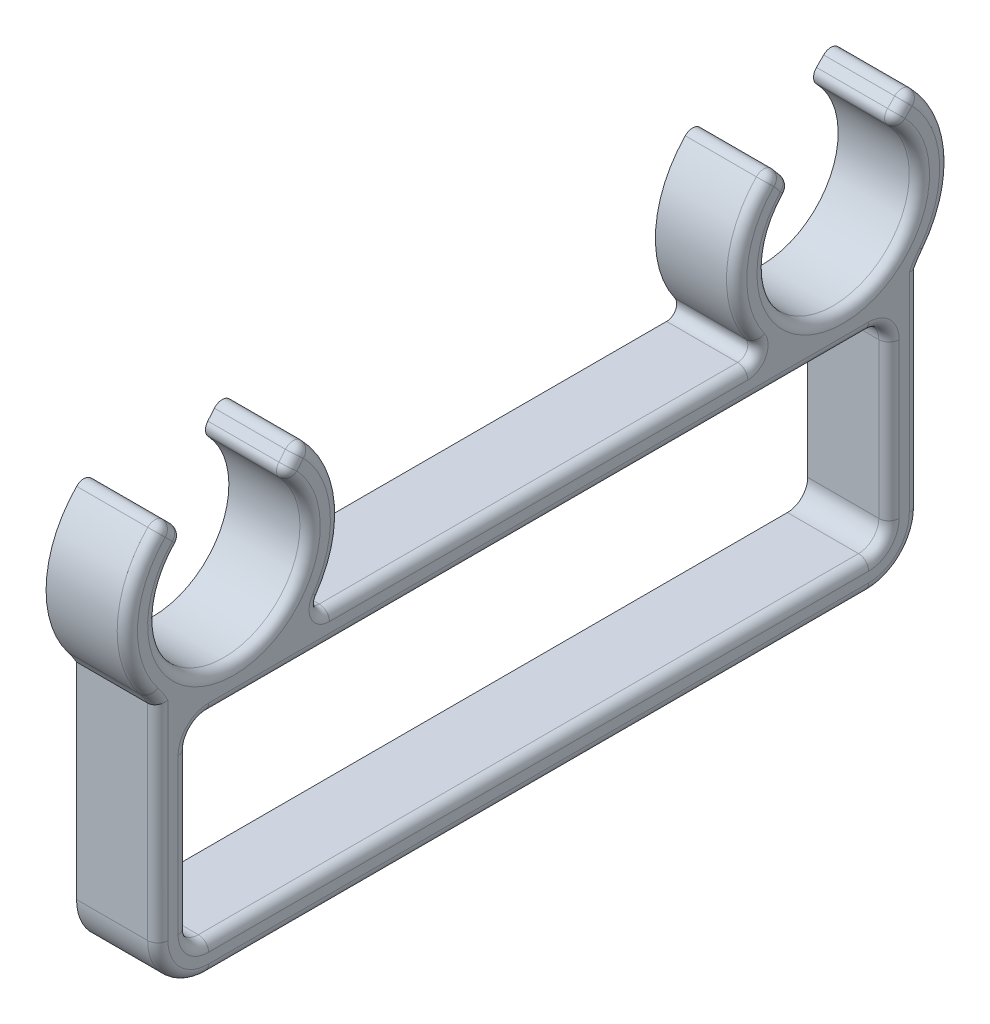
ISO-10303-21;
HEADER;
FILE_DESCRIPTION(('STEP AP214'),'2;1');
FILE_NAME('part.step','',(''),(''),'','','');
FILE_SCHEMA(('AUTOMOTIVE_DESIGN { 1 0 10303 214 1 1 1 1 }'));
ENDSEC;
DATA;
#1=APPLICATION_CONTEXT('core data for automotive mechanical design processes');
#2=APPLICATION_PROTOCOL_DEFINITION('international standard','automotive_design',2000,#1);
#3=PRODUCT_CONTEXT('',#1,'mechanical');
#4=PRODUCT('Part','Part','',(#3));
#5=PRODUCT_RELATED_PRODUCT_CATEGORY('part','',(#4));
#6=PRODUCT_DEFINITION_FORMATION('','',#4);
#7=PRODUCT_DEFINITION_CONTEXT('part definition',#1,'design');
#8=PRODUCT_DEFINITION('design','',#6,#7);
#9=PRODUCT_DEFINITION_SHAPE('','',#8);
#10=(LENGTH_UNIT() NAMED_UNIT(*) SI_UNIT(.MILLI.,.METRE.));
#11=(NAMED_UNIT(*) PLANE_ANGLE_UNIT() SI_UNIT($,.RADIAN.));
#12=(NAMED_UNIT(*) SI_UNIT($,.STERADIAN.) SOLID_ANGLE_UNIT());
#13=UNCERTAINTY_MEASURE_WITH_UNIT(LENGTH_MEASURE(1.E-05),#10,'distance_accuracy_value','');
#14=(GEOMETRIC_REPRESENTATION_CONTEXT(3) GLOBAL_UNCERTAINTY_ASSIGNED_CONTEXT((#13)) GLOBAL_UNIT_ASSIGNED_CONTEXT((#10,
#11,#12)) REPRESENTATION_CONTEXT('',''));
#15=CARTESIAN_POINT('',(0.,0.,0.));
#16=DIRECTION('',(0.,0.,1.));
#17=DIRECTION('',(1.,0.,0.));
#18=AXIS2_PLACEMENT_3D('',#15,#16,#17);
#19=CARTESIAN_POINT('',(8.,12.625,37.5));
#20=DIRECTION('',(0.,-1.,0.));
#21=DIRECTION('',(0.,0.,-1.));
#22=AXIS2_PLACEMENT_3D('',#19,#20,#21);
#23=PLANE('',#22);
#24=DIRECTION('',(1.,0.,0.));
#25=VECTOR('',#24,1.);
#26=CARTESIAN_POINT('',(8.,12.625,20.6000332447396));
#27=LINE('',#26,#25);
#28=CARTESIAN_POINT('',(0.,12.625,20.6000332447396));
#29=VERTEX_POINT('',#28);
#30=CARTESIAN_POINT('',(7.,12.625,20.6000332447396));
#31=VERTEX_POINT('',#30);
#32=EDGE_CURVE('E444',#29,#31,#27,.T.);
#33=ORIENTED_EDGE('',*,*,#32,.T.);
#34=DIRECTION('',(0.,0.,1.));
#35=VECTOR('',#34,1.);
#36=CARTESIAN_POINT('',(7.,12.625,37.5));
#37=LINE('',#36,#35);
#38=CARTESIAN_POINT('',(7.,12.625,-20.6000332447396));
#39=VERTEX_POINT('',#38);
#40=EDGE_CURVE('E11',#31,#39,#37,.F.);
#41=ORIENTED_EDGE('',*,*,#40,.T.);
#42=DIRECTION('',(1.,0.,0.));
#43=VECTOR('',#42,1.);
#44=CARTESIAN_POINT('',(0.,12.625,-20.6000332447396));
#45=LINE('',#44,#43);
#46=CARTESIAN_POINT('',(0.,12.625,-20.6000332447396));
#47=VERTEX_POINT('',#46);
#48=EDGE_CURVE('E446',#39,#47,#45,.F.);
#49=ORIENTED_EDGE('',*,*,#48,.T.);
#50=DIRECTION('',(0.,0.,1.));
#51=VECTOR('',#50,1.);
#52=CARTESIAN_POINT('',(0.,12.625,37.5));
#53=LINE('',#52,#51);
#54=EDGE_CURVE('E384',#47,#29,#53,.T.);
#55=ORIENTED_EDGE('',*,*,#54,.T.);
#56=EDGE_LOOP('',(#33,#41,#49,#55));
#57=FACE_BOUND('',#56,.T.);
#58=ADVANCED_FACE('F34',(#57),#23,.F.);
#59=CARTESIAN_POINT('',(8.,0.,0.));
#60=DIRECTION('',(-1.,0.,0.));
#61=DIRECTION('',(0.,0.,1.));
#62=AXIS2_PLACEMENT_3D('',#59,#60,#61);
#63=PLANE('',#62);
#64=DIRECTION('',(0.,0.,1.));
#65=VECTOR('',#64,1.);
#66=CARTESIAN_POINT('',(8.,10.625,-32.5));
#67=LINE('',#66,#65);
#68=CARTESIAN_POINT('',(8.,10.625,32.5));
#69=VERTEX_POINT('',#68);
#70=CARTESIAN_POINT('',(8.,10.625,-32.5));
#71=VERTEX_POINT('',#70);
#72=EDGE_CURVE('E551',#69,#71,#67,.F.);
#73=ORIENTED_EDGE('',*,*,#72,.T.);
#74=CARTESIAN_POINT('',(8.,7.625,-32.5));
#75=DIRECTION('',(-1.,0.,0.));
#76=DIRECTION('',(0.,0.,1.));
#77=AXIS2_PLACEMENT_3D('',#74,#75,#76);
#78=CIRCLE('',#77,3.);
#79=CARTESIAN_POINT('',(8.,7.625,-35.5));
#80=VERTEX_POINT('',#79);
#81=EDGE_CURVE('E565',#71,#80,#78,.T.);
#82=ORIENTED_EDGE('',*,*,#81,.T.);
#83=DIRECTION('',(0.,1.,0.));
#84=VECTOR('',#83,1.);
#85=CARTESIAN_POINT('',(8.,-7.625,-35.5));
#86=LINE('',#85,#84);
#87=CARTESIAN_POINT('',(8.,-7.625,-35.5));
#88=VERTEX_POINT('',#87);
#89=EDGE_CURVE('E563',#80,#88,#86,.F.);
#90=ORIENTED_EDGE('',*,*,#89,.T.);
#91=CARTESIAN_POINT('',(8.,-7.625,-32.5));
#92=DIRECTION('',(-1.,0.,0.));
#93=DIRECTION('',(0.,0.,1.));
#94=AXIS2_PLACEMENT_3D('',#91,#92,#93);
#95=CIRCLE('',#94,3.);
#96=CARTESIAN_POINT('',(8.,-10.625,-32.5));
#97=VERTEX_POINT('',#96);
#98=EDGE_CURVE('E561',#88,#97,#95,.T.);
#99=ORIENTED_EDGE('',*,*,#98,.T.);
#100=DIRECTION('',(0.,0.,-1.));
#101=VECTOR('',#100,1.);
#102=CARTESIAN_POINT('',(8.,-10.625,32.5));
#103=LINE('',#102,#101);
#104=CARTESIAN_POINT('',(8.,-10.625,32.5));
#105=VERTEX_POINT('',#104);
#106=EDGE_CURVE('E559',#97,#105,#103,.F.);
#107=ORIENTED_EDGE('',*,*,#106,.T.);
#108=CARTESIAN_POINT('',(8.,-7.625,32.5));
#109=DIRECTION('',(-1.,0.,0.));
#110=DIRECTION('',(0.,0.,1.));
#111=AXIS2_PLACEMENT_3D('',#108,#109,#110);
#112=CIRCLE('',#111,3.);
#113=CARTESIAN_POINT('',(8.,-7.625,35.5));
#114=VERTEX_POINT('',#113);
#115=EDGE_CURVE('E557',#105,#114,#112,.T.);
#116=ORIENTED_EDGE('',*,*,#115,.T.);
#117=DIRECTION('',(0.,-1.,0.));
#118=VECTOR('',#117,1.);
#119=CARTESIAN_POINT('',(8.,7.625,35.5));
#120=LINE('',#119,#118);
#121=CARTESIAN_POINT('',(8.,7.625,35.5));
#122=VERTEX_POINT('',#121);
#123=EDGE_CURVE('E555',#114,#122,#120,.F.);
#124=ORIENTED_EDGE('',*,*,#123,.T.);
#125=CARTESIAN_POINT('',(8.,7.625,32.5));
#126=DIRECTION('',(-1.,0.,0.));
#127=DIRECTION('',(0.,0.,1.));
#128=AXIS2_PLACEMENT_3D('',#125,#126,#127);
#129=CIRCLE('',#128,3.);
#130=EDGE_CURVE('E553',#122,#69,#129,.T.);
#131=ORIENTED_EDGE('',*,*,#130,.T.);
#132=EDGE_LOOP('',(#73,#82,#90,#99,#107,#116,#124,#131));
#133=FACE_BOUND('',#132,.T.);
#134=DIRECTION('',(0.,0.,-1.));
#135=VECTOR('',#134,1.);
#136=CARTESIAN_POINT('',(8.,-11.625,0.));
#137=LINE('',#136,#135);
#138=CARTESIAN_POINT('',(8.,-11.625,32.5));
#139=VERTEX_POINT('',#138);
#140=CARTESIAN_POINT('',(8.,-11.625,-32.5));
#141=VERTEX_POINT('',#140);
#142=EDGE_CURVE('E547',#139,#141,#137,.T.);
#143=ORIENTED_EDGE('',*,*,#142,.T.);
#144=CARTESIAN_POINT('',(8.,-7.625,-32.5));
#145=DIRECTION('',(-1.,0.,0.));
#146=DIRECTION('',(0.,0.,1.));
#147=AXIS2_PLACEMENT_3D('',#144,#145,#146);
#148=CIRCLE('',#147,4.);
#149=CARTESIAN_POINT('',(8.,-7.625,-36.5));
#150=VERTEX_POINT('',#149);
#151=EDGE_CURVE('E549',#141,#150,#148,.F.);
#152=ORIENTED_EDGE('',*,*,#151,.T.);
#153=DIRECTION('',(0.,1.,0.));
#154=VECTOR('',#153,1.);
#155=CARTESIAN_POINT('',(8.,0.,-36.5));
#156=LINE('',#155,#154);
#157=CARTESIAN_POINT('',(8.,12.8834709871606,-36.5000000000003));
#158=VERTEX_POINT('',#157);
#159=EDGE_CURVE('E540',#150,#158,#156,.T.);
#160=ORIENTED_EDGE('',*,*,#159,.T.);
#161=CARTESIAN_POINT('',(8.,7.66933741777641,-46.1857013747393));
#162=DIRECTION('',(-1.,0.,0.));
#163=DIRECTION('',(0.,0.,1.));
#164=AXIS2_PLACEMENT_3D('',#161,#162,#163);
#165=CIRCLE('',#164,11.);
#166=CARTESIAN_POINT('',(8.,14.4199368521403,-37.5006908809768));
#167=VERTEX_POINT('',#166);
#168=EDGE_CURVE('E538',#158,#167,#165,.T.);
#169=ORIENTED_EDGE('',*,*,#168,.T.);
#170=CARTESIAN_POINT('',(8.,20.25,-30.));
#171=DIRECTION('',(-1.,0.,0.));
#172=DIRECTION('',(0.,0.,1.));
#173=AXIS2_PLACEMENT_3D('',#170,#171,#172);
#174=CIRCLE('',#173,9.5);
#175=CARTESIAN_POINT('',(8.,26.9072379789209,-36.7772547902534));
#176=VERTEX_POINT('',#175);
#177=EDGE_CURVE('E536',#167,#176,#174,.F.);
#178=ORIENTED_EDGE('',*,*,#177,.T.);
#179=DIRECTION('',(0.,-0.707106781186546,0.707106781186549));
#180=VECTOR('',#179,1.);
#181=CARTESIAN_POINT('',(8.,-4.93500840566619,-4.93500840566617));
#182=LINE('',#181,#180);
#183=CARTESIAN_POINT('',(8.,26.2000996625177,-36.0701164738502));
#184=VERTEX_POINT('',#183);
#185=EDGE_CURVE('E534',#176,#184,#182,.T.);
#186=ORIENTED_EDGE('',*,*,#185,.T.);
#187=CARTESIAN_POINT('',(8.,20.25,-30.));
#188=DIRECTION('',(-1.,0.,0.));
#189=DIRECTION('',(0.,0.,1.));
#190=AXIS2_PLACEMENT_3D('',#187,#188,#189);
#191=CIRCLE('',#190,8.5);
#192=CARTESIAN_POINT('',(8.,26.0733717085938,-23.8082036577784));
#193=VERTEX_POINT('',#192);
#194=EDGE_CURVE('E532',#184,#193,#191,.T.);
#195=ORIENTED_EDGE('',*,*,#194,.T.);
#196=DIRECTION('',(0.,0.766044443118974,0.642787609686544));
#197=VECTOR('',#196,1.);
#198=CARTESIAN_POINT('',(8.,22.4961408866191,-26.8098567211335));
#199=LINE('',#198,#197);
#200=CARTESIAN_POINT('',(8.,26.8442041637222,-23.1613984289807));
#201=VERTEX_POINT('',#200);
#202=EDGE_CURVE('E530',#193,#201,#199,.T.);
#203=ORIENTED_EDGE('',*,*,#202,.T.);
#204=CARTESIAN_POINT('',(8.,20.25,-30.));
#205=DIRECTION('',(-1.,0.,0.));
#206=DIRECTION('',(0.,0.,1.));
#207=AXIS2_PLACEMENT_3D('',#204,#205,#206);
#208=CIRCLE('',#207,9.5);
#209=CARTESIAN_POINT('',(8.,14.7771739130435,-22.2348100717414));
#210=VERTEX_POINT('',#209);
#211=EDGE_CURVE('E528',#201,#210,#208,.F.);
#212=ORIENTED_EDGE('',*,*,#211,.T.);
#213=CARTESIAN_POINT('',(8.,13.625,-20.6000332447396));
#214=DIRECTION('',(-1.,0.,0.));
#215=DIRECTION('',(0.,0.,1.));
#216=AXIS2_PLACEMENT_3D('',#213,#214,#215);
#217=CIRCLE('',#216,2.);
#218=CARTESIAN_POINT('',(8.,11.625,-20.6000332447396));
#219=VERTEX_POINT('',#218);
#220=EDGE_CURVE('E526',#210,#219,#217,.T.);
#221=ORIENTED_EDGE('',*,*,#220,.T.);
#222=DIRECTION('',(0.,0.,1.));
#223=VECTOR('',#222,1.);
#224=CARTESIAN_POINT('',(8.,11.625,0.));
#225=LINE('',#224,#223);
#226=CARTESIAN_POINT('',(8.,11.625,20.6000332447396));
#227=VERTEX_POINT('',#226);
#228=EDGE_CURVE('E510',#219,#227,#225,.T.);
#229=ORIENTED_EDGE('',*,*,#228,.T.);
#230=CARTESIAN_POINT('',(8.,13.625,20.6000332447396));
#231=DIRECTION('',(-1.,0.,0.));
#232=DIRECTION('',(0.,0.,1.));
#233=AXIS2_PLACEMENT_3D('',#230,#231,#232);
#234=CIRCLE('',#233,2.);
#235=CARTESIAN_POINT('',(8.,14.7771739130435,22.2348100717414));
#236=VERTEX_POINT('',#235);
#237=EDGE_CURVE('E512',#227,#236,#234,.T.);
#238=ORIENTED_EDGE('',*,*,#237,.T.);
#239=CARTESIAN_POINT('',(8.,20.25,30.));
#240=DIRECTION('',(-1.,0.,0.));
#241=DIRECTION('',(0.,0.,1.));
#242=AXIS2_PLACEMENT_3D('',#239,#240,#241);
#243=CIRCLE('',#242,9.5);
#244=CARTESIAN_POINT('',(8.,26.8442041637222,23.1613984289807));
#245=VERTEX_POINT('',#244);
#246=EDGE_CURVE('E514',#236,#245,#243,.F.);
#247=ORIENTED_EDGE('',*,*,#246,.T.);
#248=DIRECTION('',(0.,-0.766044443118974,0.642787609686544));
#249=VECTOR('',#248,1.);
#250=CARTESIAN_POINT('',(8.,22.4961408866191,26.8098567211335));
#251=LINE('',#250,#249);
#252=CARTESIAN_POINT('',(8.,26.0733717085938,23.8082036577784));
#253=VERTEX_POINT('',#252);
#254=EDGE_CURVE('E516',#245,#253,#251,.T.);
#255=ORIENTED_EDGE('',*,*,#254,.T.);
#256=CARTESIAN_POINT('',(8.,20.25,30.));
#257=DIRECTION('',(-1.,0.,0.));
#258=DIRECTION('',(0.,0.,1.));
#259=AXIS2_PLACEMENT_3D('',#256,#257,#258);
#260=CIRCLE('',#259,8.5);
#261=CARTESIAN_POINT('',(8.,26.2000996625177,36.0701164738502));
#262=VERTEX_POINT('',#261);
#263=EDGE_CURVE('E518',#253,#262,#260,.T.);
#264=ORIENTED_EDGE('',*,*,#263,.T.);
#265=DIRECTION('',(0.,0.707106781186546,0.707106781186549));
#266=VECTOR('',#265,1.);
#267=CARTESIAN_POINT('',(8.,-4.9350084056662,4.93500840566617));
#268=LINE('',#267,#266);
#269=CARTESIAN_POINT('',(8.,26.9072379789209,36.7772547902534));
#270=VERTEX_POINT('',#269);
#271=EDGE_CURVE('E520',#262,#270,#268,.T.);
#272=ORIENTED_EDGE('',*,*,#271,.T.);
#273=CARTESIAN_POINT('',(8.,20.25,30.));
#274=DIRECTION('',(-1.,0.,0.));
#275=DIRECTION('',(0.,0.,1.));
#276=AXIS2_PLACEMENT_3D('',#273,#274,#275);
#277=CIRCLE('',#276,9.5);
#278=CARTESIAN_POINT('',(8.,14.4199368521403,37.5006908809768));
#279=VERTEX_POINT('',#278);
#280=EDGE_CURVE('E522',#270,#279,#277,.F.);
#281=ORIENTED_EDGE('',*,*,#280,.T.);
#282=CARTESIAN_POINT('',(8.,7.66933741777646,46.1857013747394));
#283=DIRECTION('',(-1.,0.,0.));
#284=DIRECTION('',(0.,0.,1.));
#285=AXIS2_PLACEMENT_3D('',#282,#283,#284);
#286=CIRCLE('',#285,11.);
#287=CARTESIAN_POINT('',(8.,12.8834709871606,36.5000000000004));
#288=VERTEX_POINT('',#287);
#289=EDGE_CURVE('E524',#279,#288,#286,.T.);
#290=ORIENTED_EDGE('',*,*,#289,.T.);
#291=DIRECTION('',(0.,-1.,0.));
#292=VECTOR('',#291,1.);
#293=CARTESIAN_POINT('',(8.,0.,36.5));
#294=LINE('',#293,#292);
#295=CARTESIAN_POINT('',(8.,-7.625,36.5));
#296=VERTEX_POINT('',#295);
#297=EDGE_CURVE('E543',#288,#296,#294,.T.);
#298=ORIENTED_EDGE('',*,*,#297,.T.);
#299=CARTESIAN_POINT('',(8.,-7.625,32.5));
#300=DIRECTION('',(-1.,0.,0.));
#301=DIRECTION('',(0.,0.,1.));
#302=AXIS2_PLACEMENT_3D('',#299,#300,#301);
#303=CIRCLE('',#302,4.);
#304=EDGE_CURVE('E545',#296,#139,#303,.F.);
#305=ORIENTED_EDGE('',*,*,#304,.T.);
#306=EDGE_LOOP('',(#143,#152,#160,#169,#178,#186,#195,#203,#212,#221,#229,#238,#247,#255,#264,
#272,#281,#290,#298,#305));
#307=FACE_BOUND('',#306,.T.);
#308=ADVANCED_FACE('F850',(#133,#307),#63,.F.);
#309=CARTESIAN_POINT('',(0.,0.,0.));
#310=DIRECTION('',(-1.,0.,0.));
#311=DIRECTION('',(0.,0.,1.));
#312=AXIS2_PLACEMENT_3D('',#309,#310,#311);
#313=PLANE('',#312);
#314=DIRECTION('',(0.,-0.707106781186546,0.707106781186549));
#315=VECTOR('',#314,1.);
#316=CARTESIAN_POINT('',(0.,26.1607723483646,-34.6165755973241));
#317=LINE('',#316,#315);
#318=CARTESIAN_POINT('',(0.,27.6143447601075,-36.0701480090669));
#319=VERTEX_POINT('',#318);
#320=CARTESIAN_POINT('',(0.,26.9072064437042,-35.3630096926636));
#321=VERTEX_POINT('',#320);
#322=EDGE_CURVE('E805',#319,#321,#317,.T.);
#323=ORIENTED_EDGE('',*,*,#322,.F.);
#324=CARTESIAN_POINT('',(0.,26.9072379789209,-36.7772547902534));
#325=DIRECTION('',(-1.,0.,0.));
#326=DIRECTION('',(0.,0.,1.));
#327=AXIS2_PLACEMENT_3D('',#324,#325,#326);
#328=CIRCLE('',#327,1.);
#329=CARTESIAN_POINT('',(0.,27.6079998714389,-37.4906500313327));
#330=VERTEX_POINT('',#329);
#331=EDGE_CURVE('E474',#319,#330,#328,.T.);
#332=ORIENTED_EDGE('',*,*,#331,.T.);
#333=CARTESIAN_POINT('',(0.,20.25,-30.));
#334=DIRECTION('',(1.,0.,0.));
#335=DIRECTION('',(0.,0.,1.));
#336=AXIS2_PLACEMENT_3D('',#333,#334,#335);
#337=CIRCLE('',#336,10.5);
#338=CARTESIAN_POINT('',(0.,13.8062459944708,-38.2902372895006));
#339=VERTEX_POINT('',#338);
#340=EDGE_CURVE('E376',#339,#330,#337,.T.);
#341=ORIENTED_EDGE('',*,*,#340,.F.);
#342=CARTESIAN_POINT('',(0.,7.66933741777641,-46.1857013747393));
#343=DIRECTION('',(-1.,0.,0.));
#344=DIRECTION('',(0.,0.,1.));
#345=AXIS2_PLACEMENT_3D('',#342,#343,#344);
#346=CIRCLE('',#345,10.);
#347=CARTESIAN_POINT('',(0.,12.625,-37.5));
#348=VERTEX_POINT('',#347);
#349=EDGE_CURVE('E358',#339,#348,#346,.F.);
#350=ORIENTED_EDGE('',*,*,#349,.T.);
#351=DIRECTION('',(0.,1.,0.));
#352=VECTOR('',#351,1.);
#353=CARTESIAN_POINT('',(0.,-12.625,-37.5));
#354=LINE('',#353,#352);
#355=CARTESIAN_POINT('',(0.,-7.625,-37.5));
#356=VERTEX_POINT('',#355);
#357=EDGE_CURVE('E374',#356,#348,#354,.T.);
#358=ORIENTED_EDGE('',*,*,#357,.F.);
#359=CARTESIAN_POINT('',(0.,-7.625,-32.5));
#360=DIRECTION('',(-1.,0.,0.));
#361=DIRECTION('',(0.,0.,1.));
#362=AXIS2_PLACEMENT_3D('',#359,#360,#361);
#363=CIRCLE('',#362,5.);
#364=CARTESIAN_POINT('',(0.,-12.625,-32.5));
#365=VERTEX_POINT('',#364);
#366=EDGE_CURVE('E425',#356,#365,#363,.T.);
#367=ORIENTED_EDGE('',*,*,#366,.T.);
#368=DIRECTION('',(0.,0.,-1.));
#369=VECTOR('',#368,1.);
#370=CARTESIAN_POINT('',(0.,-12.625,37.5));
#371=LINE('',#370,#369);
#372=CARTESIAN_POINT('',(0.,-12.625,32.5));
#373=VERTEX_POINT('',#372);
#374=EDGE_CURVE('E385',#373,#365,#371,.T.);
#375=ORIENTED_EDGE('',*,*,#374,.F.);
#376=CARTESIAN_POINT('',(0.,-7.625,32.5));
#377=DIRECTION('',(-1.,0.,0.));
#378=DIRECTION('',(0.,0.,1.));
#379=AXIS2_PLACEMENT_3D('',#376,#377,#378);
#380=CIRCLE('',#379,5.);
#381=CARTESIAN_POINT('',(0.,-7.625,37.5));
#382=VERTEX_POINT('',#381);
#383=EDGE_CURVE('E423',#373,#382,#380,.T.);
#384=ORIENTED_EDGE('',*,*,#383,.T.);
#385=DIRECTION('',(0.,-1.,0.));
#386=VECTOR('',#385,1.);
#387=CARTESIAN_POINT('',(0.,-12.625,37.5));
#388=LINE('',#387,#386);
#389=CARTESIAN_POINT('',(0.,12.625,37.5));
#390=VERTEX_POINT('',#389);
#391=EDGE_CURVE('E390',#390,#382,#388,.T.);
#392=ORIENTED_EDGE('',*,*,#391,.F.);
#393=CARTESIAN_POINT('',(0.,7.66933741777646,46.1857013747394));
#394=DIRECTION('',(-1.,0.,0.));
#395=DIRECTION('',(0.,0.,1.));
#396=AXIS2_PLACEMENT_3D('',#393,#394,#395);
#397=CIRCLE('',#396,10.);
#398=CARTESIAN_POINT('',(0.,13.8062459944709,38.2902372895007));
#399=VERTEX_POINT('',#398);
#400=EDGE_CURVE('E377',#390,#399,#397,.F.);
#401=ORIENTED_EDGE('',*,*,#400,.T.);
#402=CARTESIAN_POINT('',(0.,20.25,30.));
#403=DIRECTION('',(1.,0.,0.));
#404=DIRECTION('',(0.,0.,-1.));
#405=AXIS2_PLACEMENT_3D('',#402,#403,#404);
#406=CIRCLE('',#405,10.5);
#407=CARTESIAN_POINT('',(0.,27.6079998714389,37.4906500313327));
#408=VERTEX_POINT('',#407);
#409=EDGE_CURVE('E825',#408,#399,#406,.T.);
#410=ORIENTED_EDGE('',*,*,#409,.F.);
#411=CARTESIAN_POINT('',(0.,26.9072379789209,36.7772547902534));
#412=DIRECTION('',(-1.,0.,0.));
#413=DIRECTION('',(0.,0.,1.));
#414=AXIS2_PLACEMENT_3D('',#411,#412,#413);
#415=CIRCLE('',#414,1.);
#416=CARTESIAN_POINT('',(0.,27.6143447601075,36.0701480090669));
#417=VERTEX_POINT('',#416);
#418=EDGE_CURVE('E462',#408,#417,#415,.T.);
#419=ORIENTED_EDGE('',*,*,#418,.T.);
#420=DIRECTION('',(0.,0.707106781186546,0.707106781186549));
#421=VECTOR('',#420,1.);
#422=CARTESIAN_POINT('',(0.,26.1607723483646,34.6165755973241));
#423=LINE('',#422,#421);
#424=CARTESIAN_POINT('',(0.,26.9072064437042,35.3630096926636));
#425=VERTEX_POINT('',#424);
#426=EDGE_CURVE('E816',#425,#417,#423,.T.);
#427=ORIENTED_EDGE('',*,*,#426,.F.);
#428=CARTESIAN_POINT('',(0.,26.2000996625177,36.0701164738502));
#429=DIRECTION('',(-1.,0.,0.));
#430=DIRECTION('',(0.,0.,1.));
#431=AXIS2_PLACEMENT_3D('',#428,#429,#430);
#432=CIRCLE('',#431,1.);
#433=CARTESIAN_POINT('',(0.,25.5000879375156,35.3559851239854));
#434=VERTEX_POINT('',#433);
#435=EDGE_CURVE('E460',#425,#434,#432,.T.);
#436=ORIENTED_EDGE('',*,*,#435,.T.);
#437=CARTESIAN_POINT('',(0.,20.25,30.));
#438=DIRECTION('',(-1.,0.,0.));
#439=DIRECTION('',(0.,0.,-1.));
#440=AXIS2_PLACEMENT_3D('',#437,#438,#439);
#441=CIRCLE('',#440,7.5);
#442=CARTESIAN_POINT('',(0.,25.3882691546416,24.5366502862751));
#443=VERTEX_POINT('',#442);
#444=EDGE_CURVE('E819',#443,#434,#441,.T.);
#445=ORIENTED_EDGE('',*,*,#444,.F.);
#446=CARTESIAN_POINT('',(0.,26.0733717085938,23.8082036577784));
#447=DIRECTION('',(-1.,0.,0.));
#448=DIRECTION('',(0.,0.,1.));
#449=AXIS2_PLACEMENT_3D('',#446,#447,#448);
#450=CIRCLE('',#449,1.);
#451=CARTESIAN_POINT('',(0.,26.7161593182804,24.5742481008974));
#452=VERTEX_POINT('',#451);
#453=EDGE_CURVE('E464',#443,#452,#450,.T.);
#454=ORIENTED_EDGE('',*,*,#453,.T.);
#455=DIRECTION('',(0.,-0.766044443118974,0.642787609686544));
#456=VECTOR('',#455,1.);
#457=CARTESIAN_POINT('',(0.,25.9953333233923,25.1790929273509));
#458=LINE('',#457,#456);
#459=CARTESIAN_POINT('',(0.,27.4869917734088,23.9274428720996));
#460=VERTEX_POINT('',#459);
#461=EDGE_CURVE('E822',#460,#452,#458,.T.);
#462=ORIENTED_EDGE('',*,*,#461,.F.);
#463=CARTESIAN_POINT('',(0.,26.8442041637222,23.1613984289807));
#464=DIRECTION('',(-1.,0.,0.));
#465=DIRECTION('',(0.,0.,1.));
#466=AXIS2_PLACEMENT_3D('',#463,#464,#465);
#467=CIRCLE('',#466,1.);
#468=CARTESIAN_POINT('',(0.,27.5383309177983,22.4415456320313));
#469=VERTEX_POINT('',#468);
#470=EDGE_CURVE('E466',#460,#469,#467,.T.);
#471=ORIENTED_EDGE('',*,*,#470,.T.);
#472=CARTESIAN_POINT('',(0.,14.2010869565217,21.4174216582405));
#473=VERTEX_POINT('',#472);
#474=EDGE_CURVE('E749',#473,#469,#406,.T.);
#475=ORIENTED_EDGE('',*,*,#474,.F.);
#476=CARTESIAN_POINT('',(0.,13.625,20.6000332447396));
#477=DIRECTION('',(-1.,0.,0.));
#478=DIRECTION('',(0.,0.,1.));
#479=AXIS2_PLACEMENT_3D('',#476,#477,#478);
#480=CIRCLE('',#479,1.);
#481=EDGE_CURVE('E453',#473,#29,#480,.F.);
#482=ORIENTED_EDGE('',*,*,#481,.T.);
#483=ORIENTED_EDGE('',*,*,#54,.F.);
#484=CARTESIAN_POINT('',(0.,13.625,-20.6000332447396));
#485=DIRECTION('',(-1.,0.,0.));
#486=DIRECTION('',(0.,0.,1.));
#487=AXIS2_PLACEMENT_3D('',#484,#485,#486);
#488=CIRCLE('',#487,1.);
#489=CARTESIAN_POINT('',(0.,14.2010869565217,-21.4174216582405));
#490=VERTEX_POINT('',#489);
#491=EDGE_CURVE('E450',#47,#490,#488,.F.);
#492=ORIENTED_EDGE('',*,*,#491,.T.);
#493=CARTESIAN_POINT('',(0.,27.5383309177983,-22.4415456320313));
#494=VERTEX_POINT('',#493);
#495=EDGE_CURVE('E808',#494,#490,#337,.T.);
#496=ORIENTED_EDGE('',*,*,#495,.F.);
#497=CARTESIAN_POINT('',(0.,26.8442041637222,-23.1613984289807));
#498=DIRECTION('',(-1.,0.,0.));
#499=DIRECTION('',(0.,0.,1.));
#500=AXIS2_PLACEMENT_3D('',#497,#498,#499);
#501=CIRCLE('',#500,1.);
#502=CARTESIAN_POINT('',(0.,27.4869917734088,-23.9274428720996));
#503=VERTEX_POINT('',#502);
#504=EDGE_CURVE('E468',#494,#503,#501,.T.);
#505=ORIENTED_EDGE('',*,*,#504,.T.);
#506=DIRECTION('',(0.,0.766044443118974,0.642787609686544));
#507=VECTOR('',#506,1.);
#508=CARTESIAN_POINT('',(0.,25.9953333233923,-25.1790929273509));
#509=LINE('',#508,#507);
#510=CARTESIAN_POINT('',(0.,26.7161593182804,-24.5742481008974));
#511=VERTEX_POINT('',#510);
#512=EDGE_CURVE('E810',#511,#503,#509,.T.);
#513=ORIENTED_EDGE('',*,*,#512,.F.);
#514=CARTESIAN_POINT('',(0.,26.0733717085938,-23.8082036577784));
#515=DIRECTION('',(-1.,0.,0.));
#516=DIRECTION('',(0.,0.,1.));
#517=AXIS2_PLACEMENT_3D('',#514,#515,#516);
#518=CIRCLE('',#517,1.);
#519=CARTESIAN_POINT('',(0.,25.3882691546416,-24.5366502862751));
#520=VERTEX_POINT('',#519);
#521=EDGE_CURVE('E470',#511,#520,#518,.T.);
#522=ORIENTED_EDGE('',*,*,#521,.T.);
#523=CARTESIAN_POINT('',(0.,20.25,-30.));
#524=DIRECTION('',(-1.,0.,0.));
#525=DIRECTION('',(0.,0.,1.));
#526=AXIS2_PLACEMENT_3D('',#523,#524,#525);
#527=CIRCLE('',#526,7.5);
#528=CARTESIAN_POINT('',(0.,25.5000879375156,-35.3559851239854));
#529=VERTEX_POINT('',#528);
#530=EDGE_CURVE('E813',#529,#520,#527,.T.);
#531=ORIENTED_EDGE('',*,*,#530,.F.);
#532=CARTESIAN_POINT('',(0.,26.2000996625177,-36.0701164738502));
#533=DIRECTION('',(-1.,0.,0.));
#534=DIRECTION('',(0.,0.,1.));
#535=AXIS2_PLACEMENT_3D('',#532,#533,#534);
#536=CIRCLE('',#535,1.);
#537=EDGE_CURVE('E472',#529,#321,#536,.T.);
#538=ORIENTED_EDGE('',*,*,#537,.T.);
#539=EDGE_LOOP('',(#323,#332,#341,#350,#358,#367,#375,#384,#392,#401,#410,#419,#427,#436,#445,
#454,#462,#471,#475,#482,#483,#492,#496,#505,#513,#522,#531,#538));
#540=FACE_BOUND('',#539,.T.);
#541=DIRECTION('',(0.,-1.,0.));
#542=VECTOR('',#541,1.);
#543=CARTESIAN_POINT('',(0.,-9.625,34.5));
#544=LINE('',#543,#542);
#545=CARTESIAN_POINT('',(0.,7.625,34.5));
#546=VERTEX_POINT('',#545);
#547=CARTESIAN_POINT('',(0.,-7.625,34.5));
#548=VERTEX_POINT('',#547);
#549=EDGE_CURVE('E793',#546,#548,#544,.T.);
#550=ORIENTED_EDGE('',*,*,#549,.T.);
#551=CARTESIAN_POINT('',(0.,-7.625,32.5));
#552=DIRECTION('',(-1.,0.,0.));
#553=DIRECTION('',(0.,0.,1.));
#554=AXIS2_PLACEMENT_3D('',#551,#552,#553);
#555=CIRCLE('',#554,2.);
#556=CARTESIAN_POINT('',(0.,-9.625,32.5));
#557=VERTEX_POINT('',#556);
#558=EDGE_CURVE('E418',#548,#557,#555,.F.);
#559=ORIENTED_EDGE('',*,*,#558,.T.);
#560=DIRECTION('',(0.,0.,-1.));
#561=VECTOR('',#560,1.);
#562=CARTESIAN_POINT('',(0.,-9.625,34.5));
#563=LINE('',#562,#561);
#564=CARTESIAN_POINT('',(0.,-9.625,-32.5));
#565=VERTEX_POINT('',#564);
#566=EDGE_CURVE('E791',#557,#565,#563,.T.);
#567=ORIENTED_EDGE('',*,*,#566,.T.);
#568=CARTESIAN_POINT('',(0.,-7.625,-32.5));
#569=DIRECTION('',(-1.,0.,0.));
#570=DIRECTION('',(0.,0.,1.));
#571=AXIS2_PLACEMENT_3D('',#568,#569,#570);
#572=CIRCLE('',#571,2.);
#573=CARTESIAN_POINT('',(0.,-7.625,-34.5));
#574=VERTEX_POINT('',#573);
#575=EDGE_CURVE('E414',#565,#574,#572,.F.);
#576=ORIENTED_EDGE('',*,*,#575,.T.);
#577=DIRECTION('',(0.,1.,0.));
#578=VECTOR('',#577,1.);
#579=CARTESIAN_POINT('',(0.,-9.625,-34.5));
#580=LINE('',#579,#578);
#581=CARTESIAN_POINT('',(0.,7.625,-34.5));
#582=VERTEX_POINT('',#581);
#583=EDGE_CURVE('E802',#574,#582,#580,.T.);
#584=ORIENTED_EDGE('',*,*,#583,.T.);
#585=CARTESIAN_POINT('',(0.,7.625,-32.5));
#586=DIRECTION('',(-1.,0.,0.));
#587=DIRECTION('',(0.,0.,1.));
#588=AXIS2_PLACEMENT_3D('',#585,#586,#587);
#589=CIRCLE('',#588,2.);
#590=CARTESIAN_POINT('',(0.,9.625,-32.5));
#591=VERTEX_POINT('',#590);
#592=EDGE_CURVE('E416',#582,#591,#589,.F.);
#593=ORIENTED_EDGE('',*,*,#592,.T.);
#594=DIRECTION('',(0.,0.,1.));
#595=VECTOR('',#594,1.);
#596=CARTESIAN_POINT('',(0.,9.625,34.5));
#597=LINE('',#596,#595);
#598=CARTESIAN_POINT('',(0.,9.625,32.5));
#599=VERTEX_POINT('',#598);
#600=EDGE_CURVE('E797',#591,#599,#597,.T.);
#601=ORIENTED_EDGE('',*,*,#600,.T.);
#602=CARTESIAN_POINT('',(0.,7.625,32.5));
#603=DIRECTION('',(-1.,0.,0.));
#604=DIRECTION('',(0.,0.,1.));
#605=AXIS2_PLACEMENT_3D('',#602,#603,#604);
#606=CIRCLE('',#605,2.);
#607=EDGE_CURVE('E420',#599,#546,#606,.F.);
#608=ORIENTED_EDGE('',*,*,#607,.T.);
#609=EDGE_LOOP('',(#550,#559,#567,#576,#584,#593,#601,#608));
#610=FACE_BOUND('',#609,.T.);
#611=ADVANCED_FACE('F372',(#540,#610),#313,.T.);
#612=CARTESIAN_POINT('',(8.,-12.625,37.5));
#613=DIRECTION('',(0.,0.,-1.));
#614=DIRECTION('',(-1.,0.,0.));
#615=AXIS2_PLACEMENT_3D('',#612,#613,#614);
#616=PLANE('',#615);
#617=DIRECTION('',(-1.,0.,0.));
#618=VECTOR('',#617,1.);
#619=CARTESIAN_POINT('',(8.,-7.625,37.5));
#620=LINE('',#619,#618);
#621=CARTESIAN_POINT('',(7.,-7.625,37.5));
#622=VERTEX_POINT('',#621);
#623=EDGE_CURVE('E432',#382,#622,#620,.F.);
#624=ORIENTED_EDGE('',*,*,#623,.T.);
#625=DIRECTION('',(0.,-1.,0.));
#626=VECTOR('',#625,1.);
#627=CARTESIAN_POINT('',(7.,-12.625,37.5));
#628=LINE('',#627,#626);
#629=CARTESIAN_POINT('',(7.,12.625,37.5));
#630=VERTEX_POINT('',#629);
#631=EDGE_CURVE('E632',#622,#630,#628,.F.);
#632=ORIENTED_EDGE('',*,*,#631,.T.);
#633=DIRECTION('',(-1.,0.,0.));
#634=VECTOR('',#633,1.);
#635=CARTESIAN_POINT('',(8.,12.625,37.5));
#636=LINE('',#635,#634);
#637=EDGE_CURVE('E367',#630,#390,#636,.T.);
#638=ORIENTED_EDGE('',*,*,#637,.T.);
#639=ORIENTED_EDGE('',*,*,#391,.T.);
#640=EDGE_LOOP('',(#624,#632,#638,#639));
#641=FACE_BOUND('',#640,.T.);
#642=ADVANCED_FACE('F903',(#641),#616,.F.);
#643=CARTESIAN_POINT('',(8.,-12.625,37.5));
#644=DIRECTION('',(0.,1.,0.));
#645=DIRECTION('',(0.,0.,1.));
#646=AXIS2_PLACEMENT_3D('',#643,#644,#645);
#647=PLANE('',#646);
#648=DIRECTION('',(-1.,0.,0.));
#649=VECTOR('',#648,1.);
#650=CARTESIAN_POINT('',(8.,-12.625,-32.5));
#651=LINE('',#650,#649);
#652=CARTESIAN_POINT('',(7.,-12.625,-32.5));
#653=VERTEX_POINT('',#652);
#654=EDGE_CURVE('E429',#365,#653,#651,.F.);
#655=ORIENTED_EDGE('',*,*,#654,.T.);
#656=DIRECTION('',(0.,0.,-1.));
#657=VECTOR('',#656,1.);
#658=CARTESIAN_POINT('',(7.,-12.625,37.5));
#659=LINE('',#658,#657);
#660=CARTESIAN_POINT('',(7.,-12.625,32.5));
#661=VERTEX_POINT('',#660);
#662=EDGE_CURVE('E572',#653,#661,#659,.F.);
#663=ORIENTED_EDGE('',*,*,#662,.T.);
#664=DIRECTION('',(-1.,0.,0.));
#665=VECTOR('',#664,1.);
#666=CARTESIAN_POINT('',(8.,-12.625,32.5));
#667=LINE('',#666,#665);
#668=EDGE_CURVE('E427',#661,#373,#667,.T.);
#669=ORIENTED_EDGE('',*,*,#668,.T.);
#670=ORIENTED_EDGE('',*,*,#374,.T.);
#671=EDGE_LOOP('',(#655,#663,#669,#670));
#672=FACE_BOUND('',#671,.T.);
#673=ADVANCED_FACE('F900',(#672),#647,.F.);
#674=CARTESIAN_POINT('',(8.,-12.625,-37.5));
#675=DIRECTION('',(0.,0.,1.));
#676=DIRECTION('',(1.,0.,0.));
#677=AXIS2_PLACEMENT_3D('',#674,#675,#676);
#678=PLANE('',#677);
#679=DIRECTION('',(-1.,0.,0.));
#680=VECTOR('',#679,1.);
#681=CARTESIAN_POINT('',(8.,12.625,-37.5));
#682=LINE('',#681,#680);
#683=CARTESIAN_POINT('',(7.,12.625,-37.5));
#684=VERTEX_POINT('',#683);
#685=EDGE_CURVE('E354',#684,#348,#682,.T.);
#686=ORIENTED_EDGE('',*,*,#685,.F.);
#687=DIRECTION('',(0.,1.,0.));
#688=VECTOR('',#687,1.);
#689=CARTESIAN_POINT('',(7.,-12.625,-37.5));
#690=LINE('',#689,#688);
#691=CARTESIAN_POINT('',(7.,-7.625,-37.5));
#692=VERTEX_POINT('',#691);
#693=EDGE_CURVE('E568',#684,#692,#690,.F.);
#694=ORIENTED_EDGE('',*,*,#693,.T.);
#695=DIRECTION('',(-1.,0.,0.));
#696=VECTOR('',#695,1.);
#697=CARTESIAN_POINT('',(8.,-7.625,-37.5));
#698=LINE('',#697,#696);
#699=EDGE_CURVE('E382',#692,#356,#698,.T.);
#700=ORIENTED_EDGE('',*,*,#699,.T.);
#701=ORIENTED_EDGE('',*,*,#357,.T.);
#702=EDGE_LOOP('',(#686,#694,#700,#701));
#703=FACE_BOUND('',#702,.T.);
#704=ADVANCED_FACE('F380',(#703),#678,.F.);
#705=CARTESIAN_POINT('',(8.,-9.625,-34.5));
#706=DIRECTION('',(0.,0.,1.));
#707=DIRECTION('',(1.,0.,0.));
#708=AXIS2_PLACEMENT_3D('',#705,#706,#707);
#709=PLANE('',#708);
#710=DIRECTION('',(-1.,0.,0.));
#711=VECTOR('',#710,1.);
#712=CARTESIAN_POINT('',(8.,-7.625,-34.5));
#713=LINE('',#712,#711);
#714=CARTESIAN_POINT('',(7.,-7.625,-34.5));
#715=VERTEX_POINT('',#714);
#716=EDGE_CURVE('E401',#574,#715,#713,.F.);
#717=ORIENTED_EDGE('',*,*,#716,.T.);
#718=DIRECTION('',(0.,1.,0.));
#719=VECTOR('',#718,1.);
#720=CARTESIAN_POINT('',(7.,7.625,-34.5));
#721=LINE('',#720,#719);
#722=CARTESIAN_POINT('',(7.,7.625,-34.5));
#723=VERTEX_POINT('',#722);
#724=EDGE_CURVE('E579',#715,#723,#721,.T.);
#725=ORIENTED_EDGE('',*,*,#724,.T.);
#726=DIRECTION('',(-1.,0.,0.));
#727=VECTOR('',#726,1.);
#728=CARTESIAN_POINT('',(0.,7.625,-34.5));
#729=LINE('',#728,#727);
#730=EDGE_CURVE('E399',#723,#582,#729,.T.);
#731=ORIENTED_EDGE('',*,*,#730,.T.);
#732=ORIENTED_EDGE('',*,*,#583,.F.);
#733=EDGE_LOOP('',(#717,#725,#731,#732));
#734=FACE_BOUND('',#733,.T.);
#735=ADVANCED_FACE('F899',(#734),#709,.T.);
#736=CARTESIAN_POINT('',(8.,9.625,34.5));
#737=DIRECTION('',(0.,-1.,0.));
#738=DIRECTION('',(0.,0.,-1.));
#739=AXIS2_PLACEMENT_3D('',#736,#737,#738);
#740=PLANE('',#739);
#741=DIRECTION('',(-1.,0.,0.));
#742=VECTOR('',#741,1.);
#743=CARTESIAN_POINT('',(8.,9.625,-32.5));
#744=LINE('',#743,#742);
#745=CARTESIAN_POINT('',(7.,9.625,-32.5));
#746=VERTEX_POINT('',#745);
#747=EDGE_CURVE('E406',#591,#746,#744,.F.);
#748=ORIENTED_EDGE('',*,*,#747,.T.);
#749=DIRECTION('',(0.,0.,1.));
#750=VECTOR('',#749,1.);
#751=CARTESIAN_POINT('',(7.,9.625,32.5));
#752=LINE('',#751,#750);
#753=CARTESIAN_POINT('',(7.,9.625,32.5));
#754=VERTEX_POINT('',#753);
#755=EDGE_CURVE('E43',#746,#754,#752,.T.);
#756=ORIENTED_EDGE('',*,*,#755,.T.);
#757=DIRECTION('',(-1.,0.,0.));
#758=VECTOR('',#757,1.);
#759=CARTESIAN_POINT('',(0.,9.625,32.5));
#760=LINE('',#759,#758);
#761=EDGE_CURVE('E404',#754,#599,#760,.T.);
#762=ORIENTED_EDGE('',*,*,#761,.T.);
#763=ORIENTED_EDGE('',*,*,#600,.F.);
#764=EDGE_LOOP('',(#748,#756,#762,#763));
#765=FACE_BOUND('',#764,.T.);
#766=ADVANCED_FACE('F1437',(#765),#740,.T.);
#767=CARTESIAN_POINT('',(8.,-9.625,34.5));
#768=DIRECTION('',(0.,0.,-1.));
#769=DIRECTION('',(-1.,0.,0.));
#770=AXIS2_PLACEMENT_3D('',#767,#768,#769);
#771=PLANE('',#770);
#772=DIRECTION('',(-1.,0.,0.));
#773=VECTOR('',#772,1.);
#774=CARTESIAN_POINT('',(8.,7.625,34.5));
#775=LINE('',#774,#773);
#776=CARTESIAN_POINT('',(7.,7.625,34.5));
#777=VERTEX_POINT('',#776);
#778=EDGE_CURVE('E409',#546,#777,#775,.F.);
#779=ORIENTED_EDGE('',*,*,#778,.T.);
#780=DIRECTION('',(0.,-1.,0.));
#781=VECTOR('',#780,1.);
#782=CARTESIAN_POINT('',(7.,-7.625,34.5));
#783=LINE('',#782,#781);
#784=CARTESIAN_POINT('',(7.,-7.625,34.5));
#785=VERTEX_POINT('',#784);
#786=EDGE_CURVE('E587',#777,#785,#783,.T.);
#787=ORIENTED_EDGE('',*,*,#786,.T.);
#788=DIRECTION('',(-1.,0.,0.));
#789=VECTOR('',#788,1.);
#790=CARTESIAN_POINT('',(0.,-7.625,34.5));
#791=LINE('',#790,#789);
#792=EDGE_CURVE('E412',#785,#548,#791,.T.);
#793=ORIENTED_EDGE('',*,*,#792,.T.);
#794=ORIENTED_EDGE('',*,*,#549,.F.);
#795=EDGE_LOOP('',(#779,#787,#793,#794));
#796=FACE_BOUND('',#795,.T.);
#797=ADVANCED_FACE('F1427',(#796),#771,.T.);
#798=CARTESIAN_POINT('',(8.,-9.625,34.5));
#799=DIRECTION('',(0.,1.,0.));
#800=DIRECTION('',(0.,0.,1.));
#801=AXIS2_PLACEMENT_3D('',#798,#799,#800);
#802=PLANE('',#801);
#803=DIRECTION('',(-1.,0.,0.));
#804=VECTOR('',#803,1.);
#805=CARTESIAN_POINT('',(8.,-9.625,32.5));
#806=LINE('',#805,#804);
#807=CARTESIAN_POINT('',(7.,-9.625,32.5));
#808=VERTEX_POINT('',#807);
#809=EDGE_CURVE('E366',#557,#808,#806,.F.);
#810=ORIENTED_EDGE('',*,*,#809,.T.);
#811=DIRECTION('',(0.,0.,-1.));
#812=VECTOR('',#811,1.);
#813=CARTESIAN_POINT('',(7.,-9.625,-32.5));
#814=LINE('',#813,#812);
#815=CARTESIAN_POINT('',(7.,-9.625,-32.5));
#816=VERTEX_POINT('',#815);
#817=EDGE_CURVE('E583',#808,#816,#814,.T.);
#818=ORIENTED_EDGE('',*,*,#817,.T.);
#819=DIRECTION('',(-1.,0.,0.));
#820=VECTOR('',#819,1.);
#821=CARTESIAN_POINT('',(0.,-9.625,-32.5));
#822=LINE('',#821,#820);
#823=EDGE_CURVE('E397',#816,#565,#822,.T.);
#824=ORIENTED_EDGE('',*,*,#823,.T.);
#825=ORIENTED_EDGE('',*,*,#566,.F.);
#826=EDGE_LOOP('',(#810,#818,#824,#825));
#827=FACE_BOUND('',#826,.T.);
#828=ADVANCED_FACE('F788',(#827),#802,.T.);
#829=CARTESIAN_POINT('',(8.,20.25,-30.));
#830=DIRECTION('',(-1.,0.,0.));
#831=DIRECTION('',(0.,0.,1.));
#832=AXIS2_PLACEMENT_3D('',#829,#830,#831);
#833=CYLINDRICAL_SURFACE('',#832,10.5);
#834=DIRECTION('',(-1.,0.,0.));
#835=VECTOR('',#834,1.);
#836=CARTESIAN_POINT('',(8.,14.2010869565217,-21.4174216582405));
#837=LINE('',#836,#835);
#838=CARTESIAN_POINT('',(7.,14.2010869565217,-21.4174216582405));
#839=VERTEX_POINT('',#838);
#840=EDGE_CURVE('E441',#490,#839,#837,.F.);
#841=ORIENTED_EDGE('',*,*,#840,.T.);
#842=CARTESIAN_POINT('',(7.,20.25,-30.));
#843=DIRECTION('',(-1.,0.,0.));
#844=DIRECTION('',(0.,0.,1.));
#845=AXIS2_PLACEMENT_3D('',#842,#843,#844);
#846=CIRCLE('',#845,10.5);
#847=CARTESIAN_POINT('',(7.,27.5383309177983,-22.4415456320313));
#848=VERTEX_POINT('',#847);
#849=EDGE_CURVE('E608',#839,#848,#846,.T.);
#850=ORIENTED_EDGE('',*,*,#849,.T.);
#851=DIRECTION('',(-1.,0.,0.));
#852=VECTOR('',#851,1.);
#853=CARTESIAN_POINT('',(8.,27.5383309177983,-22.4415456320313));
#854=LINE('',#853,#852);
#855=EDGE_CURVE('E489',#848,#494,#854,.T.);
#856=ORIENTED_EDGE('',*,*,#855,.T.);
#857=ORIENTED_EDGE('',*,*,#495,.T.);
#858=EDGE_LOOP('',(#841,#850,#856,#857));
#859=FACE_BOUND('',#858,.T.);
#860=ADVANCED_FACE('F1408',(#859),#833,.T.);
#861=DIRECTION('',(-1.,0.,0.));
#862=VECTOR('',#861,1.);
#863=CARTESIAN_POINT('',(8.,27.6079998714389,-37.4906500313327));
#864=LINE('',#863,#862);
#865=CARTESIAN_POINT('',(7.,27.6079998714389,-37.4906500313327));
#866=VERTEX_POINT('',#865);
#867=EDGE_CURVE('E476',#330,#866,#864,.F.);
#868=ORIENTED_EDGE('',*,*,#867,.T.);
#869=CARTESIAN_POINT('',(7.,20.25,-30.));
#870=DIRECTION('',(-1.,0.,0.));
#871=DIRECTION('',(0.,0.,1.));
#872=AXIS2_PLACEMENT_3D('',#869,#870,#871);
#873=CIRCLE('',#872,10.5);
#874=CARTESIAN_POINT('',(7.,13.8062459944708,-38.2902372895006));
#875=VERTEX_POINT('',#874);
#876=EDGE_CURVE('E592',#866,#875,#873,.T.);
#877=ORIENTED_EDGE('',*,*,#876,.T.);
#878=DIRECTION('',(-1.,0.,0.));
#879=VECTOR('',#878,1.);
#880=CARTESIAN_POINT('',(8.,13.8062459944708,-38.2902372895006));
#881=LINE('',#880,#879);
#882=EDGE_CURVE('E435',#875,#339,#881,.T.);
#883=ORIENTED_EDGE('',*,*,#882,.T.);
#884=ORIENTED_EDGE('',*,*,#340,.T.);
#885=EDGE_LOOP('',(#868,#877,#883,#884));
#886=FACE_BOUND('',#885,.T.);
#887=ADVANCED_FACE('F1398',(#886),#833,.T.);
#888=CARTESIAN_POINT('',(8.,20.25,-30.));
#889=DIRECTION('',(-1.,0.,0.));
#890=DIRECTION('',(0.,0.,1.));
#891=AXIS2_PLACEMENT_3D('',#888,#889,#890);
#892=CYLINDRICAL_SURFACE('',#891,7.5);
#893=DIRECTION('',(-1.,0.,0.));
#894=VECTOR('',#893,1.);
#895=CARTESIAN_POINT('',(8.,25.3882691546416,-24.5366502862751));
#896=LINE('',#895,#894);
#897=CARTESIAN_POINT('',(7.,25.3882691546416,-24.5366502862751));
#898=VERTEX_POINT('',#897);
#899=EDGE_CURVE('E479',#520,#898,#896,.F.);
#900=ORIENTED_EDGE('',*,*,#899,.T.);
#901=CARTESIAN_POINT('',(7.,20.25,-30.));
#902=DIRECTION('',(-1.,0.,0.));
#903=DIRECTION('',(0.,0.,1.));
#904=AXIS2_PLACEMENT_3D('',#901,#902,#903);
#905=CIRCLE('',#904,7.5);
#906=CARTESIAN_POINT('',(7.,25.5000879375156,-35.3559851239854));
#907=VERTEX_POINT('',#906);
#908=EDGE_CURVE('E600',#898,#907,#905,.F.);
#909=ORIENTED_EDGE('',*,*,#908,.T.);
#910=DIRECTION('',(-1.,0.,0.));
#911=VECTOR('',#910,1.);
#912=CARTESIAN_POINT('',(8.,25.5000879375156,-35.3559851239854));
#913=LINE('',#912,#911);
#914=EDGE_CURVE('E482',#907,#529,#913,.T.);
#915=ORIENTED_EDGE('',*,*,#914,.T.);
#916=ORIENTED_EDGE('',*,*,#530,.T.);
#917=EDGE_LOOP('',(#900,#909,#915,#916));
#918=FACE_BOUND('',#917,.T.);
#919=ADVANCED_FACE('F1388',(#918),#892,.F.);
#920=CARTESIAN_POINT('',(8.,25.9953333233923,-25.1790929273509));
#921=DIRECTION('',(0.,-0.642787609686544,0.766044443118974));
#922=DIRECTION('',(0.,-0.766044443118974,-0.642787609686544));
#923=AXIS2_PLACEMENT_3D('',#920,#921,#922);
#924=PLANE('',#923);
#925=DIRECTION('',(-1.,0.,0.));
#926=VECTOR('',#925,1.);
#927=CARTESIAN_POINT('',(8.,27.4869917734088,-23.9274428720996));
#928=LINE('',#927,#926);
#929=CARTESIAN_POINT('',(7.,27.4869917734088,-23.9274428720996));
#930=VERTEX_POINT('',#929);
#931=EDGE_CURVE('E484',#503,#930,#928,.F.);
#932=ORIENTED_EDGE('',*,*,#931,.T.);
#933=DIRECTION('',(0.,0.766044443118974,0.642787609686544));
#934=VECTOR('',#933,1.);
#935=CARTESIAN_POINT('',(7.,25.9953333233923,-25.1790929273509));
#936=LINE('',#935,#934);
#937=CARTESIAN_POINT('',(7.,26.7161593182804,-24.5742481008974));
#938=VERTEX_POINT('',#937);
#939=EDGE_CURVE('E604',#930,#938,#936,.F.);
#940=ORIENTED_EDGE('',*,*,#939,.T.);
#941=DIRECTION('',(-1.,0.,0.));
#942=VECTOR('',#941,1.);
#943=CARTESIAN_POINT('',(8.,26.7161593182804,-24.5742481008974));
#944=LINE('',#943,#942);
#945=EDGE_CURVE('E487',#938,#511,#944,.T.);
#946=ORIENTED_EDGE('',*,*,#945,.T.);
#947=ORIENTED_EDGE('',*,*,#512,.T.);
#948=EDGE_LOOP('',(#932,#940,#946,#947));
#949=FACE_BOUND('',#948,.T.);
#950=ADVANCED_FACE('F1378',(#949),#924,.F.);
#951=CARTESIAN_POINT('',(8.,26.1607723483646,-34.6165755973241));
#952=DIRECTION('',(0.,-0.707106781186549,-0.707106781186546));
#953=DIRECTION('',(0.,0.707106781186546,-0.707106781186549));
#954=AXIS2_PLACEMENT_3D('',#951,#952,#953);
#955=PLANE('',#954);
#956=DIRECTION('',(-1.,0.,0.));
#957=VECTOR('',#956,1.);
#958=CARTESIAN_POINT('',(8.,26.9072064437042,-35.3630096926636));
#959=LINE('',#958,#957);
#960=CARTESIAN_POINT('',(7.,26.9072064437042,-35.3630096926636));
#961=VERTEX_POINT('',#960);
#962=EDGE_CURVE('E455',#321,#961,#959,.F.);
#963=ORIENTED_EDGE('',*,*,#962,.T.);
#964=DIRECTION('',(0.,-0.707106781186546,0.707106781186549));
#965=VECTOR('',#964,1.);
#966=CARTESIAN_POINT('',(7.,26.1607723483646,-34.6165755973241));
#967=LINE('',#966,#965);
#968=CARTESIAN_POINT('',(7.,27.6143447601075,-36.0701480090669));
#969=VERTEX_POINT('',#968);
#970=EDGE_CURVE('E596',#961,#969,#967,.F.);
#971=ORIENTED_EDGE('',*,*,#970,.T.);
#972=DIRECTION('',(-1.,0.,0.));
#973=VECTOR('',#972,1.);
#974=CARTESIAN_POINT('',(8.,27.6143447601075,-36.0701480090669));
#975=LINE('',#974,#973);
#976=EDGE_CURVE('E458',#969,#319,#975,.T.);
#977=ORIENTED_EDGE('',*,*,#976,.T.);
#978=ORIENTED_EDGE('',*,*,#322,.T.);
#979=EDGE_LOOP('',(#963,#971,#977,#978));
#980=FACE_BOUND('',#979,.T.);
#981=ADVANCED_FACE('F1370',(#980),#955,.F.);
#982=CARTESIAN_POINT('',(8.,20.25,30.));
#983=DIRECTION('',(-1.,0.,0.));
#984=DIRECTION('',(0.,0.,1.));
#985=AXIS2_PLACEMENT_3D('',#982,#983,#984);
#986=CYLINDRICAL_SURFACE('',#985,10.5);
#987=DIRECTION('',(-1.,0.,0.));
#988=VECTOR('',#987,1.);
#989=CARTESIAN_POINT('',(8.,13.8062459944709,38.2902372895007));
#990=LINE('',#989,#988);
#991=CARTESIAN_POINT('',(7.,13.8062459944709,38.2902372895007));
#992=VERTEX_POINT('',#991);
#993=EDGE_CURVE('E378',#399,#992,#990,.F.);
#994=ORIENTED_EDGE('',*,*,#993,.T.);
#995=CARTESIAN_POINT('',(7.,20.25,30.));
#996=DIRECTION('',(-1.,0.,0.));
#997=DIRECTION('',(0.,0.,1.));
#998=AXIS2_PLACEMENT_3D('',#995,#996,#997);
#999=CIRCLE('',#998,10.5);
#1000=CARTESIAN_POINT('',(7.,27.6079998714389,37.4906500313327));
#1001=VERTEX_POINT('',#1000);
#1002=EDGE_CURVE('E614',#992,#1001,#999,.T.);
#1003=ORIENTED_EDGE('',*,*,#1002,.T.);
#1004=DIRECTION('',(-1.,0.,0.));
#1005=VECTOR('',#1004,1.);
#1006=CARTESIAN_POINT('',(8.,27.6079998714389,37.4906500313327));
#1007=LINE('',#1006,#1005);
#1008=EDGE_CURVE('E503',#1001,#408,#1007,.T.);
#1009=ORIENTED_EDGE('',*,*,#1008,.T.);
#1010=ORIENTED_EDGE('',*,*,#409,.T.);
#1011=EDGE_LOOP('',(#994,#1003,#1009,#1010));
#1012=FACE_BOUND('',#1011,.T.);
#1013=ADVANCED_FACE('F961',(#1012),#986,.T.);
#1014=DIRECTION('',(-1.,0.,0.));
#1015=VECTOR('',#1014,1.);
#1016=CARTESIAN_POINT('',(8.,27.5383309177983,22.4415456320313));
#1017=LINE('',#1016,#1015);
#1018=CARTESIAN_POINT('',(7.,27.5383309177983,22.4415456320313));
#1019=VERTEX_POINT('',#1018);
#1020=EDGE_CURVE('E496',#469,#1019,#1017,.F.);
#1021=ORIENTED_EDGE('',*,*,#1020,.T.);
#1022=CARTESIAN_POINT('',(7.,20.25,30.));
#1023=DIRECTION('',(-1.,0.,0.));
#1024=DIRECTION('',(0.,0.,1.));
#1025=AXIS2_PLACEMENT_3D('',#1022,#1023,#1024);
#1026=CIRCLE('',#1025,10.5);
#1027=CARTESIAN_POINT('',(7.,14.2010869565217,21.4174216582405));
#1028=VERTEX_POINT('',#1027);
#1029=EDGE_CURVE('E59',#1019,#1028,#1026,.T.);
#1030=ORIENTED_EDGE('',*,*,#1029,.T.);
#1031=DIRECTION('',(-1.,0.,0.));
#1032=VECTOR('',#1031,1.);
#1033=CARTESIAN_POINT('',(8.,14.2010869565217,21.4174216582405));
#1034=LINE('',#1033,#1032);
#1035=EDGE_CURVE('E448',#1028,#473,#1034,.T.);
#1036=ORIENTED_EDGE('',*,*,#1035,.T.);
#1037=ORIENTED_EDGE('',*,*,#474,.T.);
#1038=EDGE_LOOP('',(#1021,#1030,#1036,#1037));
#1039=FACE_BOUND('',#1038,.T.);
#1040=ADVANCED_FACE('F831',(#1039),#986,.T.);
#1041=CARTESIAN_POINT('',(8.,25.9953333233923,25.1790929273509));
#1042=DIRECTION('',(0.,-0.642787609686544,-0.766044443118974));
#1043=DIRECTION('',(0.,0.766044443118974,-0.642787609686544));
#1044=AXIS2_PLACEMENT_3D('',#1041,#1042,#1043);
#1045=PLANE('',#1044);
#1046=DIRECTION('',(-1.,0.,0.));
#1047=VECTOR('',#1046,1.);
#1048=CARTESIAN_POINT('',(8.,26.7161593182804,24.5742481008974));
#1049=LINE('',#1048,#1047);
#1050=CARTESIAN_POINT('',(7.,26.7161593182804,24.5742481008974));
#1051=VERTEX_POINT('',#1050);
#1052=EDGE_CURVE('E491',#452,#1051,#1049,.F.);
#1053=ORIENTED_EDGE('',*,*,#1052,.T.);
#1054=DIRECTION('',(0.,-0.766044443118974,0.642787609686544));
#1055=VECTOR('',#1054,1.);
#1056=CARTESIAN_POINT('',(7.,25.9953333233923,25.1790929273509));
#1057=LINE('',#1056,#1055);
#1058=CARTESIAN_POINT('',(7.,27.4869917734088,23.9274428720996));
#1059=VERTEX_POINT('',#1058);
#1060=EDGE_CURVE('E626',#1051,#1059,#1057,.F.);
#1061=ORIENTED_EDGE('',*,*,#1060,.T.);
#1062=DIRECTION('',(-1.,0.,0.));
#1063=VECTOR('',#1062,1.);
#1064=CARTESIAN_POINT('',(8.,27.4869917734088,23.9274428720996));
#1065=LINE('',#1064,#1063);
#1066=EDGE_CURVE('E494',#1059,#460,#1065,.T.);
#1067=ORIENTED_EDGE('',*,*,#1066,.T.);
#1068=ORIENTED_EDGE('',*,*,#461,.T.);
#1069=EDGE_LOOP('',(#1053,#1061,#1067,#1068));
#1070=FACE_BOUND('',#1069,.T.);
#1071=ADVANCED_FACE('F1344',(#1070),#1045,.F.);
#1072=CARTESIAN_POINT('',(8.,20.25,30.));
#1073=DIRECTION('',(-1.,0.,0.));
#1074=DIRECTION('',(0.,0.,1.));
#1075=AXIS2_PLACEMENT_3D('',#1072,#1073,#1074);
#1076=CYLINDRICAL_SURFACE('',#1075,7.5);
#1077=DIRECTION('',(-1.,0.,0.));
#1078=VECTOR('',#1077,1.);
#1079=CARTESIAN_POINT('',(8.,25.5000879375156,35.3559851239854));
#1080=LINE('',#1079,#1078);
#1081=CARTESIAN_POINT('',(7.,25.5000879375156,35.3559851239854));
#1082=VERTEX_POINT('',#1081);
#1083=EDGE_CURVE('E498',#434,#1082,#1080,.F.);
#1084=ORIENTED_EDGE('',*,*,#1083,.T.);
#1085=CARTESIAN_POINT('',(7.,20.25,30.));
#1086=DIRECTION('',(-1.,0.,0.));
#1087=DIRECTION('',(0.,0.,1.));
#1088=AXIS2_PLACEMENT_3D('',#1085,#1086,#1087);
#1089=CIRCLE('',#1088,7.5);
#1090=CARTESIAN_POINT('',(7.,25.3882691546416,24.5366502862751));
#1091=VERTEX_POINT('',#1090);
#1092=EDGE_CURVE('E622',#1082,#1091,#1089,.F.);
#1093=ORIENTED_EDGE('',*,*,#1092,.T.);
#1094=DIRECTION('',(-1.,0.,0.));
#1095=VECTOR('',#1094,1.);
#1096=CARTESIAN_POINT('',(8.,25.3882691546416,24.5366502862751));
#1097=LINE('',#1096,#1095);
#1098=EDGE_CURVE('E501',#1091,#443,#1097,.T.);
#1099=ORIENTED_EDGE('',*,*,#1098,.T.);
#1100=ORIENTED_EDGE('',*,*,#444,.T.);
#1101=EDGE_LOOP('',(#1084,#1093,#1099,#1100));
#1102=FACE_BOUND('',#1101,.T.);
#1103=ADVANCED_FACE('F988',(#1102),#1076,.F.);
#1104=CARTESIAN_POINT('',(8.,26.1607723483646,34.6165755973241));
#1105=DIRECTION('',(0.,-0.707106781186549,0.707106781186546));
#1106=DIRECTION('',(0.,-0.707106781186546,-0.707106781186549));
#1107=AXIS2_PLACEMENT_3D('',#1104,#1105,#1106);
#1108=PLANE('',#1107);
#1109=DIRECTION('',(-1.,0.,0.));
#1110=VECTOR('',#1109,1.);
#1111=CARTESIAN_POINT('',(8.,27.6143447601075,36.0701480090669));
#1112=LINE('',#1111,#1110);
#1113=CARTESIAN_POINT('',(7.,27.6143447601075,36.0701480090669));
#1114=VERTEX_POINT('',#1113);
#1115=EDGE_CURVE('E507',#417,#1114,#1112,.F.);
#1116=ORIENTED_EDGE('',*,*,#1115,.T.);
#1117=DIRECTION('',(0.,0.707106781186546,0.707106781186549));
#1118=VECTOR('',#1117,1.);
#1119=CARTESIAN_POINT('',(7.,26.1607723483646,34.6165755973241));
#1120=LINE('',#1119,#1118);
#1121=CARTESIAN_POINT('',(7.,26.9072064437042,35.3630096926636));
#1122=VERTEX_POINT('',#1121);
#1123=EDGE_CURVE('E618',#1114,#1122,#1120,.F.);
#1124=ORIENTED_EDGE('',*,*,#1123,.T.);
#1125=DIRECTION('',(-1.,0.,0.));
#1126=VECTOR('',#1125,1.);
#1127=CARTESIAN_POINT('',(8.,26.9072064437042,35.3630096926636));
#1128=LINE('',#1127,#1126);
#1129=EDGE_CURVE('E505',#1122,#425,#1128,.T.);
#1130=ORIENTED_EDGE('',*,*,#1129,.T.);
#1131=ORIENTED_EDGE('',*,*,#426,.T.);
#1132=EDGE_LOOP('',(#1116,#1124,#1130,#1131));
#1133=FACE_BOUND('',#1132,.T.);
#1134=ADVANCED_FACE('F912',(#1133),#1108,.F.);
#1135=CARTESIAN_POINT('',(8.,-7.625,-32.5));
#1136=DIRECTION('',(1.,0.,0.));
#1137=DIRECTION('',(0.,0.,-1.));
#1138=AXIS2_PLACEMENT_3D('',#1135,#1136,#1137);
#1139=CYLINDRICAL_SURFACE('',#1138,2.);
#1140=ORIENTED_EDGE('',*,*,#823,.F.);
#1141=CARTESIAN_POINT('',(7.,-7.625,-32.5));
#1142=DIRECTION('',(-1.,0.,0.));
#1143=DIRECTION('',(0.,0.,1.));
#1144=AXIS2_PLACEMENT_3D('',#1141,#1142,#1143);
#1145=CIRCLE('',#1144,2.);
#1146=EDGE_CURVE('E581',#816,#715,#1145,.F.);
#1147=ORIENTED_EDGE('',*,*,#1146,.T.);
#1148=ORIENTED_EDGE('',*,*,#716,.F.);
#1149=ORIENTED_EDGE('',*,*,#575,.F.);
#1150=EDGE_LOOP('',(#1140,#1147,#1148,#1149));
#1151=FACE_BOUND('',#1150,.T.);
#1152=ADVANCED_FACE('F908',(#1151),#1139,.F.);
#1153=CARTESIAN_POINT('',(8.,7.625,-32.5));
#1154=DIRECTION('',(1.,0.,0.));
#1155=DIRECTION('',(0.,0.,-1.));
#1156=AXIS2_PLACEMENT_3D('',#1153,#1154,#1155);
#1157=CYLINDRICAL_SURFACE('',#1156,2.);
#1158=ORIENTED_EDGE('',*,*,#730,.F.);
#1159=CARTESIAN_POINT('',(7.,7.625,-32.5));
#1160=DIRECTION('',(-1.,0.,0.));
#1161=DIRECTION('',(0.,0.,1.));
#1162=AXIS2_PLACEMENT_3D('',#1159,#1160,#1161);
#1163=CIRCLE('',#1162,2.);
#1164=EDGE_CURVE('E576',#723,#746,#1163,.F.);
#1165=ORIENTED_EDGE('',*,*,#1164,.T.);
#1166=ORIENTED_EDGE('',*,*,#747,.F.);
#1167=ORIENTED_EDGE('',*,*,#592,.F.);
#1168=EDGE_LOOP('',(#1158,#1165,#1166,#1167));
#1169=FACE_BOUND('',#1168,.T.);
#1170=ADVANCED_FACE('F911',(#1169),#1157,.F.);
#1171=CARTESIAN_POINT('',(8.,-7.625,32.5));
#1172=DIRECTION('',(1.,0.,0.));
#1173=DIRECTION('',(0.,0.,-1.));
#1174=AXIS2_PLACEMENT_3D('',#1171,#1172,#1173);
#1175=CYLINDRICAL_SURFACE('',#1174,2.);
#1176=ORIENTED_EDGE('',*,*,#792,.F.);
#1177=CARTESIAN_POINT('',(7.,-7.625,32.5));
#1178=DIRECTION('',(-1.,0.,0.));
#1179=DIRECTION('',(0.,0.,1.));
#1180=AXIS2_PLACEMENT_3D('',#1177,#1178,#1179);
#1181=CIRCLE('',#1180,2.);
#1182=EDGE_CURVE('E585',#785,#808,#1181,.F.);
#1183=ORIENTED_EDGE('',*,*,#1182,.T.);
#1184=ORIENTED_EDGE('',*,*,#809,.F.);
#1185=ORIENTED_EDGE('',*,*,#558,.F.);
#1186=EDGE_LOOP('',(#1176,#1183,#1184,#1185));
#1187=FACE_BOUND('',#1186,.T.);
#1188=ADVANCED_FACE('F784',(#1187),#1175,.F.);
#1189=CARTESIAN_POINT('',(8.,7.625,32.5));
#1190=DIRECTION('',(1.,0.,0.));
#1191=DIRECTION('',(0.,0.,-1.));
#1192=AXIS2_PLACEMENT_3D('',#1189,#1190,#1191);
#1193=CYLINDRICAL_SURFACE('',#1192,2.);
#1194=ORIENTED_EDGE('',*,*,#761,.F.);
#1195=CARTESIAN_POINT('',(7.,7.625,32.5));
#1196=DIRECTION('',(-1.,0.,0.));
#1197=DIRECTION('',(0.,0.,1.));
#1198=AXIS2_PLACEMENT_3D('',#1195,#1196,#1197);
#1199=CIRCLE('',#1198,2.);
#1200=EDGE_CURVE('E589',#754,#777,#1199,.F.);
#1201=ORIENTED_EDGE('',*,*,#1200,.T.);
#1202=ORIENTED_EDGE('',*,*,#778,.F.);
#1203=ORIENTED_EDGE('',*,*,#607,.F.);
#1204=EDGE_LOOP('',(#1194,#1201,#1202,#1203));
#1205=FACE_BOUND('',#1204,.T.);
#1206=ADVANCED_FACE('F919',(#1205),#1193,.F.);
#1207=CARTESIAN_POINT('',(8.,-7.625,-32.5));
#1208=DIRECTION('',(-1.,0.,0.));
#1209=DIRECTION('',(0.,0.,1.));
#1210=AXIS2_PLACEMENT_3D('',#1207,#1208,#1209);
#1211=CYLINDRICAL_SURFACE('',#1210,5.);
#1212=ORIENTED_EDGE('',*,*,#699,.F.);
#1213=CARTESIAN_POINT('',(7.,-7.625,-32.5));
#1214=DIRECTION('',(-1.,0.,0.));
#1215=DIRECTION('',(0.,0.,1.));
#1216=AXIS2_PLACEMENT_3D('',#1213,#1214,#1215);
#1217=CIRCLE('',#1216,5.);
#1218=EDGE_CURVE('E570',#692,#653,#1217,.T.);
#1219=ORIENTED_EDGE('',*,*,#1218,.T.);
#1220=ORIENTED_EDGE('',*,*,#654,.F.);
#1221=ORIENTED_EDGE('',*,*,#366,.F.);
#1222=EDGE_LOOP('',(#1212,#1219,#1220,#1221));
#1223=FACE_BOUND('',#1222,.T.);
#1224=ADVANCED_FACE('F922',(#1223),#1211,.T.);
#1225=CARTESIAN_POINT('',(8.,-7.625,32.5));
#1226=DIRECTION('',(-1.,0.,0.));
#1227=DIRECTION('',(0.,0.,1.));
#1228=AXIS2_PLACEMENT_3D('',#1225,#1226,#1227);
#1229=CYLINDRICAL_SURFACE('',#1228,5.);
#1230=ORIENTED_EDGE('',*,*,#668,.F.);
#1231=CARTESIAN_POINT('',(7.,-7.625,32.5));
#1232=DIRECTION('',(-1.,0.,0.));
#1233=DIRECTION('',(0.,0.,1.));
#1234=AXIS2_PLACEMENT_3D('',#1231,#1232,#1233);
#1235=CIRCLE('',#1234,5.);
#1236=EDGE_CURVE('E574',#661,#622,#1235,.T.);
#1237=ORIENTED_EDGE('',*,*,#1236,.T.);
#1238=ORIENTED_EDGE('',*,*,#623,.F.);
#1239=ORIENTED_EDGE('',*,*,#383,.F.);
#1240=EDGE_LOOP('',(#1230,#1237,#1238,#1239));
#1241=FACE_BOUND('',#1240,.T.);
#1242=ADVANCED_FACE('F926',(#1241),#1229,.T.);
#1243=CARTESIAN_POINT('',(8.,7.66933741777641,-46.1857013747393));
#1244=DIRECTION('',(1.,0.,0.));
#1245=DIRECTION('',(0.,0.,-1.));
#1246=AXIS2_PLACEMENT_3D('',#1243,#1244,#1245);
#1247=CYLINDRICAL_SURFACE('',#1246,10.);
#1248=ORIENTED_EDGE('',*,*,#882,.F.);
#1249=CARTESIAN_POINT('',(7.,7.66933741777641,-46.1857013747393));
#1250=DIRECTION('',(-1.,0.,0.));
#1251=DIRECTION('',(0.,0.,1.));
#1252=AXIS2_PLACEMENT_3D('',#1249,#1250,#1251);
#1253=CIRCLE('',#1252,10.);
#1254=EDGE_CURVE('E361',#875,#684,#1253,.F.);
#1255=ORIENTED_EDGE('',*,*,#1254,.T.);
#1256=ORIENTED_EDGE('',*,*,#685,.T.);
#1257=ORIENTED_EDGE('',*,*,#349,.F.);
#1258=EDGE_LOOP('',(#1248,#1255,#1256,#1257));
#1259=FACE_BOUND('',#1258,.T.);
#1260=ADVANCED_FACE('F357',(#1259),#1247,.F.);
#1261=CARTESIAN_POINT('',(8.,7.66933741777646,46.1857013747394));
#1262=DIRECTION('',(-1.,0.,0.));
#1263=DIRECTION('',(0.,0.,1.));
#1264=AXIS2_PLACEMENT_3D('',#1261,#1262,#1263);
#1265=CYLINDRICAL_SURFACE('',#1264,10.);
#1266=ORIENTED_EDGE('',*,*,#637,.F.);
#1267=CARTESIAN_POINT('',(7.,7.66933741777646,46.1857013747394));
#1268=DIRECTION('',(-1.,0.,0.));
#1269=DIRECTION('',(0.,0.,1.));
#1270=AXIS2_PLACEMENT_3D('',#1267,#1268,#1269);
#1271=CIRCLE('',#1270,10.);
#1272=EDGE_CURVE('E612',#630,#992,#1271,.F.);
#1273=ORIENTED_EDGE('',*,*,#1272,.T.);
#1274=ORIENTED_EDGE('',*,*,#993,.F.);
#1275=ORIENTED_EDGE('',*,*,#400,.F.);
#1276=EDGE_LOOP('',(#1266,#1273,#1274,#1275));
#1277=FACE_BOUND('',#1276,.T.);
#1278=ADVANCED_FACE('F886',(#1277),#1265,.F.);
#1279=CARTESIAN_POINT('',(8.,13.625,-20.6000332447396));
#1280=DIRECTION('',(-1.,0.,0.));
#1281=DIRECTION('',(0.,0.,1.));
#1282=AXIS2_PLACEMENT_3D('',#1279,#1280,#1281);
#1283=CYLINDRICAL_SURFACE('',#1282,1.);
#1284=ORIENTED_EDGE('',*,*,#48,.F.);
#1285=CARTESIAN_POINT('',(7.,13.625,-20.6000332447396));
#1286=DIRECTION('',(-1.,0.,0.));
#1287=DIRECTION('',(0.,0.,1.));
#1288=AXIS2_PLACEMENT_3D('',#1285,#1286,#1287);
#1289=CIRCLE('',#1288,1.);
#1290=EDGE_CURVE('E610',#39,#839,#1289,.F.);
#1291=ORIENTED_EDGE('',*,*,#1290,.T.);
#1292=ORIENTED_EDGE('',*,*,#840,.F.);
#1293=ORIENTED_EDGE('',*,*,#491,.F.);
#1294=EDGE_LOOP('',(#1284,#1291,#1292,#1293));
#1295=FACE_BOUND('',#1294,.T.);
#1296=ADVANCED_FACE('F872',(#1295),#1283,.F.);
#1297=CARTESIAN_POINT('',(8.,13.625,20.6000332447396));
#1298=DIRECTION('',(-1.,0.,0.));
#1299=DIRECTION('',(0.,0.,1.));
#1300=AXIS2_PLACEMENT_3D('',#1297,#1298,#1299);
#1301=CYLINDRICAL_SURFACE('',#1300,1.);
#1302=ORIENTED_EDGE('',*,*,#1035,.F.);
#1303=CARTESIAN_POINT('',(7.,13.625,20.6000332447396));
#1304=DIRECTION('',(-1.,0.,0.));
#1305=DIRECTION('',(0.,0.,1.));
#1306=AXIS2_PLACEMENT_3D('',#1303,#1304,#1305);
#1307=CIRCLE('',#1306,1.);
#1308=EDGE_CURVE('E51',#1028,#31,#1307,.F.);
#1309=ORIENTED_EDGE('',*,*,#1308,.T.);
#1310=ORIENTED_EDGE('',*,*,#32,.F.);
#1311=ORIENTED_EDGE('',*,*,#481,.F.);
#1312=EDGE_LOOP('',(#1302,#1309,#1310,#1311));
#1313=FACE_BOUND('',#1312,.T.);
#1314=ADVANCED_FACE('F875',(#1313),#1301,.F.);
#1315=CARTESIAN_POINT('',(8.,26.9072379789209,-36.7772547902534));
#1316=DIRECTION('',(-1.,0.,0.));
#1317=DIRECTION('',(0.,0.,1.));
#1318=AXIS2_PLACEMENT_3D('',#1315,#1316,#1317);
#1319=CYLINDRICAL_SURFACE('',#1318,1.);
#1320=ORIENTED_EDGE('',*,*,#976,.F.);
#1321=CARTESIAN_POINT('',(7.,26.9072379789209,-36.7772547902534));
#1322=DIRECTION('',(-1.,0.,0.));
#1323=DIRECTION('',(0.,0.,1.));
#1324=AXIS2_PLACEMENT_3D('',#1321,#1322,#1323);
#1325=CIRCLE('',#1324,1.);
#1326=EDGE_CURVE('E594',#969,#866,#1325,.T.);
#1327=ORIENTED_EDGE('',*,*,#1326,.T.);
#1328=ORIENTED_EDGE('',*,*,#867,.F.);
#1329=ORIENTED_EDGE('',*,*,#331,.F.);
#1330=EDGE_LOOP('',(#1320,#1327,#1328,#1329));
#1331=FACE_BOUND('',#1330,.T.);
#1332=ADVANCED_FACE('F877',(#1331),#1319,.T.);
#1333=CARTESIAN_POINT('',(8.,26.2000996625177,-36.0701164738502));
#1334=DIRECTION('',(-1.,0.,0.));
#1335=DIRECTION('',(0.,0.,1.));
#1336=AXIS2_PLACEMENT_3D('',#1333,#1334,#1335);
#1337=CYLINDRICAL_SURFACE('',#1336,1.);
#1338=ORIENTED_EDGE('',*,*,#914,.F.);
#1339=CARTESIAN_POINT('',(7.,26.2000996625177,-36.0701164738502));
#1340=DIRECTION('',(-1.,0.,0.));
#1341=DIRECTION('',(0.,0.,1.));
#1342=AXIS2_PLACEMENT_3D('',#1339,#1340,#1341);
#1343=CIRCLE('',#1342,1.);
#1344=EDGE_CURVE('E598',#907,#961,#1343,.T.);
#1345=ORIENTED_EDGE('',*,*,#1344,.T.);
#1346=ORIENTED_EDGE('',*,*,#962,.F.);
#1347=ORIENTED_EDGE('',*,*,#537,.F.);
#1348=EDGE_LOOP('',(#1338,#1345,#1346,#1347));
#1349=FACE_BOUND('',#1348,.T.);
#1350=ADVANCED_FACE('F883',(#1349),#1337,.T.);
#1351=CARTESIAN_POINT('',(8.,26.0733717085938,-23.8082036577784));
#1352=DIRECTION('',(-1.,0.,0.));
#1353=DIRECTION('',(0.,0.,1.));
#1354=AXIS2_PLACEMENT_3D('',#1351,#1352,#1353);
#1355=CYLINDRICAL_SURFACE('',#1354,1.);
#1356=ORIENTED_EDGE('',*,*,#945,.F.);
#1357=CARTESIAN_POINT('',(7.,26.0733717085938,-23.8082036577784));
#1358=DIRECTION('',(-1.,0.,0.));
#1359=DIRECTION('',(0.,0.,1.));
#1360=AXIS2_PLACEMENT_3D('',#1357,#1358,#1359);
#1361=CIRCLE('',#1360,1.);
#1362=EDGE_CURVE('E602',#938,#898,#1361,.T.);
#1363=ORIENTED_EDGE('',*,*,#1362,.T.);
#1364=ORIENTED_EDGE('',*,*,#899,.F.);
#1365=ORIENTED_EDGE('',*,*,#521,.F.);
#1366=EDGE_LOOP('',(#1356,#1363,#1364,#1365));
#1367=FACE_BOUND('',#1366,.T.);
#1368=ADVANCED_FACE('F1246',(#1367),#1355,.T.);
#1369=CARTESIAN_POINT('',(8.,26.8442041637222,-23.1613984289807));
#1370=DIRECTION('',(-1.,0.,0.));
#1371=DIRECTION('',(0.,0.,1.));
#1372=AXIS2_PLACEMENT_3D('',#1369,#1370,#1371);
#1373=CYLINDRICAL_SURFACE('',#1372,1.);
#1374=ORIENTED_EDGE('',*,*,#855,.F.);
#1375=CARTESIAN_POINT('',(7.,26.8442041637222,-23.1613984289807));
#1376=DIRECTION('',(-1.,0.,0.));
#1377=DIRECTION('',(0.,0.,1.));
#1378=AXIS2_PLACEMENT_3D('',#1375,#1376,#1377);
#1379=CIRCLE('',#1378,1.);
#1380=EDGE_CURVE('E606',#848,#930,#1379,.T.);
#1381=ORIENTED_EDGE('',*,*,#1380,.T.);
#1382=ORIENTED_EDGE('',*,*,#931,.F.);
#1383=ORIENTED_EDGE('',*,*,#504,.F.);
#1384=EDGE_LOOP('',(#1374,#1381,#1382,#1383));
#1385=FACE_BOUND('',#1384,.T.);
#1386=ADVANCED_FACE('F1237',(#1385),#1373,.T.);
#1387=CARTESIAN_POINT('',(8.,26.8442041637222,23.1613984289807));
#1388=DIRECTION('',(-1.,0.,0.));
#1389=DIRECTION('',(0.,0.,1.));
#1390=AXIS2_PLACEMENT_3D('',#1387,#1388,#1389);
#1391=CYLINDRICAL_SURFACE('',#1390,1.);
#1392=ORIENTED_EDGE('',*,*,#1066,.F.);
#1393=CARTESIAN_POINT('',(7.,26.8442041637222,23.1613984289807));
#1394=DIRECTION('',(-1.,0.,0.));
#1395=DIRECTION('',(0.,0.,1.));
#1396=AXIS2_PLACEMENT_3D('',#1393,#1394,#1395);
#1397=CIRCLE('',#1396,1.);
#1398=EDGE_CURVE('E628',#1059,#1019,#1397,.T.);
#1399=ORIENTED_EDGE('',*,*,#1398,.T.);
#1400=ORIENTED_EDGE('',*,*,#1020,.F.);
#1401=ORIENTED_EDGE('',*,*,#470,.F.);
#1402=EDGE_LOOP('',(#1392,#1399,#1400,#1401));
#1403=FACE_BOUND('',#1402,.T.);
#1404=ADVANCED_FACE('F836',(#1403),#1391,.T.);
#1405=CARTESIAN_POINT('',(8.,26.0733717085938,23.8082036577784));
#1406=DIRECTION('',(-1.,0.,0.));
#1407=DIRECTION('',(0.,0.,1.));
#1408=AXIS2_PLACEMENT_3D('',#1405,#1406,#1407);
#1409=CYLINDRICAL_SURFACE('',#1408,1.);
#1410=ORIENTED_EDGE('',*,*,#1098,.F.);
#1411=CARTESIAN_POINT('',(7.,26.0733717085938,23.8082036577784));
#1412=DIRECTION('',(-1.,0.,0.));
#1413=DIRECTION('',(0.,0.,1.));
#1414=AXIS2_PLACEMENT_3D('',#1411,#1412,#1413);
#1415=CIRCLE('',#1414,1.);
#1416=EDGE_CURVE('E624',#1091,#1051,#1415,.T.);
#1417=ORIENTED_EDGE('',*,*,#1416,.T.);
#1418=ORIENTED_EDGE('',*,*,#1052,.F.);
#1419=ORIENTED_EDGE('',*,*,#453,.F.);
#1420=EDGE_LOOP('',(#1410,#1417,#1418,#1419));
#1421=FACE_BOUND('',#1420,.T.);
#1422=ADVANCED_FACE('F992',(#1421),#1409,.T.);
#1423=CARTESIAN_POINT('',(8.,26.9072379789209,36.7772547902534));
#1424=DIRECTION('',(-1.,0.,0.));
#1425=DIRECTION('',(0.,0.,1.));
#1426=AXIS2_PLACEMENT_3D('',#1423,#1424,#1425);
#1427=CYLINDRICAL_SURFACE('',#1426,1.);
#1428=ORIENTED_EDGE('',*,*,#1008,.F.);
#1429=CARTESIAN_POINT('',(7.,26.9072379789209,36.7772547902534));
#1430=DIRECTION('',(-1.,0.,0.));
#1431=DIRECTION('',(0.,0.,1.));
#1432=AXIS2_PLACEMENT_3D('',#1429,#1430,#1431);
#1433=CIRCLE('',#1432,1.);
#1434=EDGE_CURVE('E616',#1001,#1114,#1433,.T.);
#1435=ORIENTED_EDGE('',*,*,#1434,.T.);
#1436=ORIENTED_EDGE('',*,*,#1115,.F.);
#1437=ORIENTED_EDGE('',*,*,#418,.F.);
#1438=EDGE_LOOP('',(#1428,#1435,#1436,#1437));
#1439=FACE_BOUND('',#1438,.T.);
#1440=ADVANCED_FACE('F965',(#1439),#1427,.T.);
#1441=CARTESIAN_POINT('',(8.,26.2000996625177,36.0701164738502));
#1442=DIRECTION('',(-1.,0.,0.));
#1443=DIRECTION('',(0.,0.,1.));
#1444=AXIS2_PLACEMENT_3D('',#1441,#1442,#1443);
#1445=CYLINDRICAL_SURFACE('',#1444,1.);
#1446=ORIENTED_EDGE('',*,*,#1129,.F.);
#1447=CARTESIAN_POINT('',(7.,26.2000996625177,36.0701164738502));
#1448=DIRECTION('',(-1.,0.,0.));
#1449=DIRECTION('',(0.,0.,1.));
#1450=AXIS2_PLACEMENT_3D('',#1447,#1448,#1449);
#1451=CIRCLE('',#1450,1.);
#1452=EDGE_CURVE('E620',#1122,#1082,#1451,.T.);
#1453=ORIENTED_EDGE('',*,*,#1452,.T.);
#1454=ORIENTED_EDGE('',*,*,#1083,.F.);
#1455=ORIENTED_EDGE('',*,*,#435,.F.);
#1456=EDGE_LOOP('',(#1446,#1453,#1454,#1455));
#1457=FACE_BOUND('',#1456,.T.);
#1458=ADVANCED_FACE('F978',(#1457),#1445,.T.);
#1459=CARTESIAN_POINT('',(7.,20.25,30.));
#1460=DIRECTION('',(-1.,0.,0.));
#1461=DIRECTION('',(0.,0.,1.));
#1462=AXIS2_PLACEMENT_3D('',#1459,#1460,#1461);
#1463=TOROIDAL_SURFACE('',#1462,9.5,1.);
#1464=CARTESIAN_POINT('',(7.,14.7771739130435,22.2348100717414));
#1465=DIRECTION('',(0.,-0.817388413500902,0.576086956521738));
#1466=DIRECTION('',(0.,-0.576086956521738,-0.817388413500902));
#1467=AXIS2_PLACEMENT_3D('',#1464,#1465,#1466);
#1468=CIRCLE('',#1467,1.);
#1469=EDGE_CURVE('E743',#1028,#236,#1468,.T.);
#1470=ORIENTED_EDGE('',*,*,#1469,.F.);
#1471=ORIENTED_EDGE('',*,*,#1029,.F.);
#1472=CARTESIAN_POINT('',(7.,26.8442041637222,23.1613984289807));
#1473=DIRECTION('',(0.,0.719852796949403,0.694126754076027));
#1474=DIRECTION('',(0.,-0.694126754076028,0.719852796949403));
#1475=AXIS2_PLACEMENT_3D('',#1472,#1473,#1474);
#1476=CIRCLE('',#1475,1.);
#1477=EDGE_CURVE('E746',#245,#1019,#1476,.T.);
#1478=ORIENTED_EDGE('',*,*,#1477,.F.);
#1479=ORIENTED_EDGE('',*,*,#246,.F.);
#1480=EDGE_LOOP('',(#1470,#1471,#1478,#1479));
#1481=FACE_BOUND('',#1480,.T.);
#1482=ADVANCED_FACE('F857',(#1481),#1463,.T.);
#1483=CARTESIAN_POINT('',(7.,26.8442041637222,23.1613984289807));
#1484=DIRECTION('',(0.,0.,1.));
#1485=DIRECTION('',(1.,0.,0.));
#1486=AXIS2_PLACEMENT_3D('',#1483,#1484,#1485);
#1487=SPHERICAL_SURFACE('',#1486,1.);
#1488=ORIENTED_EDGE('',*,*,#1477,.T.);
#1489=ORIENTED_EDGE('',*,*,#1398,.F.);
#1490=CARTESIAN_POINT('',(7.,26.8442041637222,23.1613984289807));
#1491=DIRECTION('',(0.,-0.766044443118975,0.642787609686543));
#1492=DIRECTION('',(0.,-0.642787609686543,-0.766044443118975));
#1493=AXIS2_PLACEMENT_3D('',#1490,#1491,#1492);
#1494=CIRCLE('',#1493,1.);
#1495=EDGE_CURVE('E740',#245,#1059,#1494,.T.);
#1496=ORIENTED_EDGE('',*,*,#1495,.F.);
#1497=EDGE_LOOP('',(#1488,#1489,#1496));
#1498=FACE_BOUND('',#1497,.T.);
#1499=ADVANCED_FACE('F841',(#1498),#1487,.T.);
#1500=CARTESIAN_POINT('',(7.,13.625,20.6000332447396));
#1501=DIRECTION('',(-1.,0.,0.));
#1502=DIRECTION('',(0.,0.,1.));
#1503=AXIS2_PLACEMENT_3D('',#1500,#1501,#1502);
#1504=TOROIDAL_SURFACE('',#1503,2.,1.);
#1505=ORIENTED_EDGE('',*,*,#1469,.T.);
#1506=ORIENTED_EDGE('',*,*,#237,.F.);
#1507=CARTESIAN_POINT('',(7.,11.625,20.6000332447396));
#1508=DIRECTION('',(0.,0.,-1.));
#1509=DIRECTION('',(-1.,0.,0.));
#1510=AXIS2_PLACEMENT_3D('',#1507,#1508,#1509);
#1511=CIRCLE('',#1510,1.);
#1512=EDGE_CURVE('E737',#31,#227,#1511,.T.);
#1513=ORIENTED_EDGE('',*,*,#1512,.F.);
#1514=ORIENTED_EDGE('',*,*,#1308,.F.);
#1515=EDGE_LOOP('',(#1505,#1506,#1513,#1514));
#1516=FACE_BOUND('',#1515,.T.);
#1517=ADVANCED_FACE('F860',(#1516),#1504,.T.);
#1518=CARTESIAN_POINT('',(7.,22.4961408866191,26.8098567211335));
#1519=DIRECTION('',(0.,-0.766044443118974,0.642787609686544));
#1520=DIRECTION('',(0.,-0.642787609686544,-0.766044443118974));
#1521=AXIS2_PLACEMENT_3D('',#1518,#1519,#1520);
#1522=CYLINDRICAL_SURFACE('',#1521,1.);
#1523=ORIENTED_EDGE('',*,*,#1495,.T.);
#1524=ORIENTED_EDGE('',*,*,#1060,.F.);
#1525=CARTESIAN_POINT('',(7.,26.0733717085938,23.8082036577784));
#1526=DIRECTION('',(0.,-0.766044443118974,0.642787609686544));
#1527=DIRECTION('',(0.,-0.642787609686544,-0.766044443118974));
#1528=AXIS2_PLACEMENT_3D('',#1525,#1526,#1527);
#1529=CIRCLE('',#1528,1.);
#1530=EDGE_CURVE('E734',#253,#1051,#1529,.T.);
#1531=ORIENTED_EDGE('',*,*,#1530,.F.);
#1532=ORIENTED_EDGE('',*,*,#254,.F.);
#1533=EDGE_LOOP('',(#1523,#1524,#1531,#1532));
#1534=FACE_BOUND('',#1533,.T.);
#1535=ADVANCED_FACE('F846',(#1534),#1522,.T.);
#1536=CARTESIAN_POINT('',(7.,11.625,0.));
#1537=DIRECTION('',(0.,0.,1.));
#1538=DIRECTION('',(1.,0.,0.));
#1539=AXIS2_PLACEMENT_3D('',#1536,#1537,#1538);
#1540=CYLINDRICAL_SURFACE('',#1539,1.);
#1541=ORIENTED_EDGE('',*,*,#1512,.T.);
#1542=ORIENTED_EDGE('',*,*,#228,.F.);
#1543=CARTESIAN_POINT('',(7.,11.625,-20.6000332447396));
#1544=DIRECTION('',(0.,0.,-1.));
#1545=DIRECTION('',(-1.,0.,0.));
#1546=AXIS2_PLACEMENT_3D('',#1543,#1544,#1545);
#1547=CIRCLE('',#1546,1.);
#1548=EDGE_CURVE('E731',#39,#219,#1547,.T.);
#1549=ORIENTED_EDGE('',*,*,#1548,.F.);
#1550=ORIENTED_EDGE('',*,*,#40,.F.);
#1551=EDGE_LOOP('',(#1541,#1542,#1549,#1550));
#1552=FACE_BOUND('',#1551,.T.);
#1553=ADVANCED_FACE('F865',(#1552),#1540,.T.);
#1554=CARTESIAN_POINT('',(7.,26.0733717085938,23.8082036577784));
#1555=DIRECTION('',(0.,0.,1.));
#1556=DIRECTION('',(1.,0.,0.));
#1557=AXIS2_PLACEMENT_3D('',#1554,#1555,#1556);
#1558=SPHERICAL_SURFACE('',#1557,1.);
#1559=ORIENTED_EDGE('',*,*,#1530,.T.);
#1560=ORIENTED_EDGE('',*,*,#1416,.F.);
#1561=CARTESIAN_POINT('',(7.,26.0733717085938,23.8082036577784));
#1562=DIRECTION('',(0.,-0.728446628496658,-0.685102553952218));
#1563=DIRECTION('',(0.,0.685102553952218,-0.728446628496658));
#1564=AXIS2_PLACEMENT_3D('',#1561,#1562,#1563);
#1565=CIRCLE('',#1564,1.);
#1566=EDGE_CURVE('E728',#253,#1091,#1565,.T.);
#1567=ORIENTED_EDGE('',*,*,#1566,.F.);
#1568=EDGE_LOOP('',(#1559,#1560,#1567));
#1569=FACE_BOUND('',#1568,.T.);
#1570=ADVANCED_FACE('F996',(#1569),#1558,.T.);
#1571=CARTESIAN_POINT('',(7.,13.625,-20.6000332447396));
#1572=DIRECTION('',(-1.,0.,0.));
#1573=DIRECTION('',(0.,0.,1.));
#1574=AXIS2_PLACEMENT_3D('',#1571,#1572,#1573);
#1575=TOROIDAL_SURFACE('',#1574,2.,1.);
#1576=ORIENTED_EDGE('',*,*,#1548,.T.);
#1577=ORIENTED_EDGE('',*,*,#220,.F.);
#1578=CARTESIAN_POINT('',(7.,14.7771739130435,-22.2348100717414));
#1579=DIRECTION('',(0.,0.817388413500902,0.576086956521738));
#1580=DIRECTION('',(0.,-0.576086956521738,0.817388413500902));
#1581=AXIS2_PLACEMENT_3D('',#1578,#1579,#1580);
#1582=CIRCLE('',#1581,1.);
#1583=EDGE_CURVE('E725',#839,#210,#1582,.T.);
#1584=ORIENTED_EDGE('',*,*,#1583,.F.);
#1585=ORIENTED_EDGE('',*,*,#1290,.F.);
#1586=EDGE_LOOP('',(#1576,#1577,#1584,#1585));
#1587=FACE_BOUND('',#1586,.T.);
#1588=ADVANCED_FACE('F998',(#1587),#1575,.T.);
#1589=CARTESIAN_POINT('',(7.,20.25,30.));
#1590=DIRECTION('',(-1.,0.,0.));
#1591=DIRECTION('',(0.,0.,1.));
#1592=AXIS2_PLACEMENT_3D('',#1589,#1590,#1591);
#1593=TOROIDAL_SURFACE('',#1592,8.5,1.);
#1594=ORIENTED_EDGE('',*,*,#1566,.T.);
#1595=ORIENTED_EDGE('',*,*,#1092,.F.);
#1596=CARTESIAN_POINT('',(7.,26.2000996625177,36.0701164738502));
#1597=DIRECTION('',(0.,0.714131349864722,-0.700011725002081));
#1598=DIRECTION('',(0.,0.700011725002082,0.714131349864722));
#1599=AXIS2_PLACEMENT_3D('',#1596,#1597,#1598);
#1600=CIRCLE('',#1599,1.);
#1601=EDGE_CURVE('E722',#262,#1082,#1600,.T.);
#1602=ORIENTED_EDGE('',*,*,#1601,.F.);
#1603=ORIENTED_EDGE('',*,*,#263,.F.);
#1604=EDGE_LOOP('',(#1594,#1595,#1602,#1603));
#1605=FACE_BOUND('',#1604,.T.);
#1606=ADVANCED_FACE('F985',(#1605),#1593,.T.);
#1607=CARTESIAN_POINT('',(7.,20.25,-30.));
#1608=DIRECTION('',(-1.,0.,0.));
#1609=DIRECTION('',(0.,0.,1.));
#1610=AXIS2_PLACEMENT_3D('',#1607,#1608,#1609);
#1611=TOROIDAL_SURFACE('',#1610,9.5,1.);
#1612=ORIENTED_EDGE('',*,*,#1583,.T.);
#1613=ORIENTED_EDGE('',*,*,#211,.F.);
#1614=CARTESIAN_POINT('',(7.,26.8442041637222,-23.1613984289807));
#1615=DIRECTION('',(0.,0.719852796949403,-0.694126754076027));
#1616=DIRECTION('',(0.,0.694126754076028,0.719852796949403));
#1617=AXIS2_PLACEMENT_3D('',#1614,#1615,#1616);
#1618=CIRCLE('',#1617,1.);
#1619=EDGE_CURVE('E719',#848,#201,#1618,.T.);
#1620=ORIENTED_EDGE('',*,*,#1619,.F.);
#1621=ORIENTED_EDGE('',*,*,#849,.F.);
#1622=EDGE_LOOP('',(#1612,#1613,#1620,#1621));
#1623=FACE_BOUND('',#1622,.T.);
#1624=ADVANCED_FACE('F1150',(#1623),#1611,.T.);
#1625=CARTESIAN_POINT('',(7.,26.2000996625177,36.0701164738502));
#1626=DIRECTION('',(0.,0.,1.));
#1627=DIRECTION('',(1.,0.,0.));
#1628=AXIS2_PLACEMENT_3D('',#1625,#1626,#1627);
#1629=SPHERICAL_SURFACE('',#1628,1.);
#1630=ORIENTED_EDGE('',*,*,#1601,.T.);
#1631=ORIENTED_EDGE('',*,*,#1452,.F.);
#1632=CARTESIAN_POINT('',(7.,26.2000996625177,36.0701164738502));
#1633=DIRECTION('',(0.,0.707106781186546,0.707106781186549));
#1634=DIRECTION('',(0.,-0.707106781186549,0.707106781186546));
#1635=AXIS2_PLACEMENT_3D('',#1632,#1633,#1634);
#1636=CIRCLE('',#1635,1.);
#1637=EDGE_CURVE('E716',#262,#1122,#1636,.T.);
#1638=ORIENTED_EDGE('',*,*,#1637,.F.);
#1639=EDGE_LOOP('',(#1630,#1631,#1638));
#1640=FACE_BOUND('',#1639,.T.);
#1641=ADVANCED_FACE('F982',(#1640),#1629,.T.);
#1642=CARTESIAN_POINT('',(7.,26.8442041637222,-23.1613984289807));
#1643=DIRECTION('',(0.,0.,1.));
#1644=DIRECTION('',(1.,0.,0.));
#1645=AXIS2_PLACEMENT_3D('',#1642,#1643,#1644);
#1646=SPHERICAL_SURFACE('',#1645,1.);
#1647=ORIENTED_EDGE('',*,*,#1380,.F.);
#1648=ORIENTED_EDGE('',*,*,#1619,.T.);
#1649=CARTESIAN_POINT('',(7.,26.8442041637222,-23.1613984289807));
#1650=DIRECTION('',(0.,-0.766044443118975,-0.642787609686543));
#1651=DIRECTION('',(0.,0.642787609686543,-0.766044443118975));
#1652=AXIS2_PLACEMENT_3D('',#1649,#1650,#1651);
#1653=CIRCLE('',#1652,1.);
#1654=EDGE_CURVE('E713',#930,#201,#1653,.T.);
#1655=ORIENTED_EDGE('',*,*,#1654,.F.);
#1656=EDGE_LOOP('',(#1647,#1648,#1655));
#1657=FACE_BOUND('',#1656,.T.);
#1658=ADVANCED_FACE('F1136',(#1657),#1646,.T.);
#1659=CARTESIAN_POINT('',(7.,-4.93500840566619,4.93500840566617));
#1660=DIRECTION('',(0.,0.707106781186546,0.707106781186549));
#1661=DIRECTION('',(0.,-0.707106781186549,0.707106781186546));
#1662=AXIS2_PLACEMENT_3D('',#1659,#1660,#1661);
#1663=CYLINDRICAL_SURFACE('',#1662,1.);
#1664=ORIENTED_EDGE('',*,*,#1637,.T.);
#1665=ORIENTED_EDGE('',*,*,#1123,.F.);
#1666=CARTESIAN_POINT('',(7.,26.9072379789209,36.7772547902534));
#1667=DIRECTION('',(0.,0.707106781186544,0.707106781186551));
#1668=DIRECTION('',(0.,-0.707106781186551,0.707106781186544));
#1669=AXIS2_PLACEMENT_3D('',#1666,#1667,#1668);
#1670=CIRCLE('',#1669,1.);
#1671=EDGE_CURVE('E710',#270,#1114,#1670,.T.);
#1672=ORIENTED_EDGE('',*,*,#1671,.F.);
#1673=ORIENTED_EDGE('',*,*,#271,.F.);
#1674=EDGE_LOOP('',(#1664,#1665,#1672,#1673));
#1675=FACE_BOUND('',#1674,.T.);
#1676=ADVANCED_FACE('F971',(#1675),#1663,.T.);
#1677=CARTESIAN_POINT('',(7.,22.4961408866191,-26.8098567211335));
#1678=DIRECTION('',(0.,0.766044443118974,0.642787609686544));
#1679=DIRECTION('',(0.,-0.642787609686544,0.766044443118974));
#1680=AXIS2_PLACEMENT_3D('',#1677,#1678,#1679);
#1681=CYLINDRICAL_SURFACE('',#1680,1.);
#1682=ORIENTED_EDGE('',*,*,#1654,.T.);
#1683=ORIENTED_EDGE('',*,*,#202,.F.);
#1684=CARTESIAN_POINT('',(7.,26.0733717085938,-23.8082036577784));
#1685=DIRECTION('',(0.,-0.766044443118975,-0.642787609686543));
#1686=DIRECTION('',(0.,0.642787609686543,-0.766044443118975));
#1687=AXIS2_PLACEMENT_3D('',#1684,#1685,#1686);
#1688=CIRCLE('',#1687,1.);
#1689=EDGE_CURVE('E707',#938,#193,#1688,.T.);
#1690=ORIENTED_EDGE('',*,*,#1689,.F.);
#1691=ORIENTED_EDGE('',*,*,#939,.F.);
#1692=EDGE_LOOP('',(#1682,#1683,#1690,#1691));
#1693=FACE_BOUND('',#1692,.T.);
#1694=ADVANCED_FACE('F1122',(#1693),#1681,.T.);
#1695=CARTESIAN_POINT('',(7.,26.9072379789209,36.7772547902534));
#1696=DIRECTION('',(0.,0.,1.));
#1697=DIRECTION('',(1.,0.,0.));
#1698=AXIS2_PLACEMENT_3D('',#1695,#1696,#1697);
#1699=SPHERICAL_SURFACE('',#1698,1.);
#1700=ORIENTED_EDGE('',*,*,#1671,.T.);
#1701=ORIENTED_EDGE('',*,*,#1434,.F.);
#1702=CARTESIAN_POINT('',(7.,26.9072379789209,36.7772547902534));
#1703=DIRECTION('',(0.,-0.713395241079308,0.700761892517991));
#1704=DIRECTION('',(0.,-0.700761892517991,-0.713395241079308));
#1705=AXIS2_PLACEMENT_3D('',#1702,#1703,#1704);
#1706=CIRCLE('',#1705,1.);
#1707=EDGE_CURVE('E704',#270,#1001,#1706,.T.);
#1708=ORIENTED_EDGE('',*,*,#1707,.F.);
#1709=EDGE_LOOP('',(#1700,#1701,#1708));
#1710=FACE_BOUND('',#1709,.T.);
#1711=ADVANCED_FACE('F968',(#1710),#1699,.T.);
#1712=CARTESIAN_POINT('',(7.,26.0733717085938,-23.8082036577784));
#1713=DIRECTION('',(0.,0.,1.));
#1714=DIRECTION('',(1.,0.,0.));
#1715=AXIS2_PLACEMENT_3D('',#1712,#1713,#1714);
#1716=SPHERICAL_SURFACE('',#1715,1.);
#1717=ORIENTED_EDGE('',*,*,#1362,.F.);
#1718=ORIENTED_EDGE('',*,*,#1689,.T.);
#1719=CARTESIAN_POINT('',(7.,26.0733717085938,-23.8082036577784));
#1720=DIRECTION('',(0.,-0.728446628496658,0.685102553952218));
#1721=DIRECTION('',(0.,-0.685102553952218,-0.728446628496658));
#1722=AXIS2_PLACEMENT_3D('',#1719,#1720,#1721);
#1723=CIRCLE('',#1722,1.);
#1724=EDGE_CURVE('E701',#898,#193,#1723,.T.);
#1725=ORIENTED_EDGE('',*,*,#1724,.F.);
#1726=EDGE_LOOP('',(#1717,#1718,#1725));
#1727=FACE_BOUND('',#1726,.T.);
#1728=ADVANCED_FACE('F1108',(#1727),#1716,.T.);
#1729=CARTESIAN_POINT('',(7.,20.25,30.));
#1730=DIRECTION('',(-1.,0.,0.));
#1731=DIRECTION('',(0.,0.,1.));
#1732=AXIS2_PLACEMENT_3D('',#1729,#1730,#1731);
#1733=TOROIDAL_SURFACE('',#1732,9.5,1.);
#1734=ORIENTED_EDGE('',*,*,#1707,.T.);
#1735=ORIENTED_EDGE('',*,*,#1002,.F.);
#1736=CARTESIAN_POINT('',(7.,14.4199368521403,37.5006908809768));
#1737=DIRECTION('',(0.,-0.789546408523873,-0.61369085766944));
#1738=DIRECTION('',(0.,0.61369085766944,-0.789546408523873));
#1739=AXIS2_PLACEMENT_3D('',#1736,#1737,#1738);
#1740=CIRCLE('',#1739,1.);
#1741=EDGE_CURVE('E698',#279,#992,#1740,.T.);
#1742=ORIENTED_EDGE('',*,*,#1741,.F.);
#1743=ORIENTED_EDGE('',*,*,#280,.F.);
#1744=EDGE_LOOP('',(#1734,#1735,#1742,#1743));
#1745=FACE_BOUND('',#1744,.T.);
#1746=ADVANCED_FACE('F958',(#1745),#1733,.T.);
#1747=CARTESIAN_POINT('',(7.,20.25,-30.));
#1748=DIRECTION('',(-1.,0.,0.));
#1749=DIRECTION('',(0.,0.,1.));
#1750=AXIS2_PLACEMENT_3D('',#1747,#1748,#1749);
#1751=TOROIDAL_SURFACE('',#1750,8.5,1.);
#1752=ORIENTED_EDGE('',*,*,#1724,.T.);
#1753=ORIENTED_EDGE('',*,*,#194,.F.);
#1754=CARTESIAN_POINT('',(7.,26.2000996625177,-36.0701164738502));
#1755=DIRECTION('',(0.,0.714131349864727,0.700011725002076));
#1756=DIRECTION('',(0.,-0.700011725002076,0.714131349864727));
#1757=AXIS2_PLACEMENT_3D('',#1754,#1755,#1756);
#1758=CIRCLE('',#1757,1.);
#1759=EDGE_CURVE('E693',#907,#184,#1758,.T.);
#1760=ORIENTED_EDGE('',*,*,#1759,.F.);
#1761=ORIENTED_EDGE('',*,*,#908,.F.);
#1762=EDGE_LOOP('',(#1752,#1753,#1760,#1761));
#1763=FACE_BOUND('',#1762,.T.);
#1764=ADVANCED_FACE('F1095',(#1763),#1751,.T.);
#1765=CARTESIAN_POINT('',(7.,7.66933741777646,46.1857013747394));
#1766=DIRECTION('',(-1.,0.,0.));
#1767=DIRECTION('',(0.,0.,1.));
#1768=AXIS2_PLACEMENT_3D('',#1765,#1766,#1767);
#1769=TOROIDAL_SURFACE('',#1768,11.,1.);
#1770=ORIENTED_EDGE('',*,*,#1741,.T.);
#1771=ORIENTED_EDGE('',*,*,#1272,.F.);
#1772=CARTESIAN_POINT('',(7.,12.625,37.5));
#1773=CARTESIAN_POINT('',(7.02746320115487,12.6249998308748,37.5000003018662));
#1774=CARTESIAN_POINT('',(7.05491298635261,12.6253002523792,37.4988679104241));
#1775=CARTESIAN_POINT('',(7.1096106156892,12.6264973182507,37.4943535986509));
#1776=CARTESIAN_POINT('',(7.13685848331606,12.6273938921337,37.4909719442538));
#1777=CARTESIAN_POINT('',(7.21790920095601,12.630964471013,37.4774992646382));
#1778=CARTESIAN_POINT('',(7.27116008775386,12.6345193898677,37.4640803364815));
#1779=CARTESIAN_POINT('',(7.3745587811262,12.6438458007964,37.4288135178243));
#1780=CARTESIAN_POINT('',(7.4247061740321,12.6496175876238,37.4069645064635));
#1781=CARTESIAN_POINT('',(7.52057773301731,12.663168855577,37.3555445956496));
#1782=CARTESIAN_POINT('',(7.56630166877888,12.6709484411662,37.3259732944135));
#1783=CARTESIAN_POINT('',(7.65278820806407,12.6883778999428,37.2595299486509));
#1784=CARTESIAN_POINT('',(7.69346766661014,12.6980536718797,37.2225566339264));
#1785=CARTESIAN_POINT('',(7.76808131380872,12.7188866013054,37.1426812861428));
#1786=CARTESIAN_POINT('',(7.80201317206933,12.730044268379,37.0997772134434));
#1787=CARTESIAN_POINT('',(7.86328868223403,12.7538707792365,37.0078205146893));
#1788=CARTESIAN_POINT('',(7.8903910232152,12.7665761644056,36.9586167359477));
#1789=CARTESIAN_POINT('',(7.93593673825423,12.792821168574,36.8565684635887));
#1790=CARTESIAN_POINT('',(7.95438285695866,12.8063605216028,36.803725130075));
#1791=CARTESIAN_POINT('',(7.97845902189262,12.8301689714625,36.710419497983));
#1792=CARTESIAN_POINT('',(7.98620341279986,12.8403358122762,36.6704594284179));
#1793=CARTESIAN_POINT('',(7.996768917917,12.8607545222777,36.589964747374));
#1794=CARTESIAN_POINT('',(7.99959893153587,12.8710062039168,36.5494313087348));
#1795=CARTESIAN_POINT('',(7.99998680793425,12.8819740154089,36.505938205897));
#1796=CARTESIAN_POINT('',(8.00000003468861,12.8827226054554,36.502969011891));
#1797=CARTESIAN_POINT('',(8.,12.8834709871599,36.5));
#1798=B_SPLINE_CURVE_WITH_KNOTS('',3,(#1772,#1773,#1774,#1775,#1776,#1777,#1778,#1779,#1780,
#1781,#1782,#1783,#1784,#1785,#1786,#1787,#1788,#1789,#1790,#1791,#1792,#1793,#1794,#1795,#1796,
#1797),.UNSPECIFIED.,.F.,.F.,(4,2,2,2,2,2,2,2,2,2,2,2,4),(0.,0.0823381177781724,
0.164666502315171,0.32890597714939,0.493167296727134,0.657437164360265,0.824130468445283,
0.990881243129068,1.16288683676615,1.33483785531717,1.46043853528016,1.58581152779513,
1.59499780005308),.UNSPECIFIED.);
#1799=EDGE_CURVE('E686',#288,#630,#1798,.F.);
#1800=ORIENTED_EDGE('',*,*,#1799,.F.);
#1801=ORIENTED_EDGE('',*,*,#289,.F.);
#1802=EDGE_LOOP('',(#1770,#1771,#1800,#1801));
#1803=FACE_BOUND('',#1802,.T.);
#1804=ADVANCED_FACE('F682',(#1803),#1769,.T.);
#1805=CARTESIAN_POINT('',(7.,26.2000996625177,-36.0701164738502));
#1806=DIRECTION('',(0.,0.,1.));
#1807=DIRECTION('',(1.,0.,0.));
#1808=AXIS2_PLACEMENT_3D('',#1805,#1806,#1807);
#1809=SPHERICAL_SURFACE('',#1808,1.);
#1810=ORIENTED_EDGE('',*,*,#1344,.F.);
#1811=ORIENTED_EDGE('',*,*,#1759,.T.);
#1812=CARTESIAN_POINT('',(7.,26.2000996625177,-36.0701164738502));
#1813=DIRECTION('',(0.,0.707106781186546,-0.707106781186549));
#1814=DIRECTION('',(0.,0.707106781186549,0.707106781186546));
#1815=AXIS2_PLACEMENT_3D('',#1812,#1813,#1814);
#1816=CIRCLE('',#1815,1.);
#1817=EDGE_CURVE('E694',#961,#184,#1816,.T.);
#1818=ORIENTED_EDGE('',*,*,#1817,.F.);
#1819=EDGE_LOOP('',(#1810,#1811,#1818));
#1820=FACE_BOUND('',#1819,.T.);
#1821=ADVANCED_FACE('F680',(#1820),#1809,.T.);
#1822=CARTESIAN_POINT('',(7.,0.,36.5));
#1823=DIRECTION('',(0.,-1.,0.));
#1824=DIRECTION('',(0.,0.,-1.));
#1825=AXIS2_PLACEMENT_3D('',#1822,#1823,#1824);
#1826=CYLINDRICAL_SURFACE('',#1825,1.);
#1827=ORIENTED_EDGE('',*,*,#1799,.T.);
#1828=ORIENTED_EDGE('',*,*,#631,.F.);
#1829=CARTESIAN_POINT('',(7.,-7.625,36.5));
#1830=DIRECTION('',(0.,-1.,0.));
#1831=DIRECTION('',(0.,0.,-1.));
#1832=AXIS2_PLACEMENT_3D('',#1829,#1830,#1831);
#1833=CIRCLE('',#1832,1.);
#1834=EDGE_CURVE('E950',#296,#622,#1833,.T.);
#1835=ORIENTED_EDGE('',*,*,#1834,.F.);
#1836=ORIENTED_EDGE('',*,*,#297,.F.);
#1837=EDGE_LOOP('',(#1827,#1828,#1835,#1836));
#1838=FACE_BOUND('',#1837,.T.);
#1839=ADVANCED_FACE('F675',(#1838),#1826,.T.);
#1840=CARTESIAN_POINT('',(7.,-4.93500840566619,-4.93500840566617));
#1841=DIRECTION('',(0.,-0.707106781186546,0.707106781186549));
#1842=DIRECTION('',(0.,-0.707106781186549,-0.707106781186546));
#1843=AXIS2_PLACEMENT_3D('',#1840,#1841,#1842);
#1844=CYLINDRICAL_SURFACE('',#1843,1.);
#1845=ORIENTED_EDGE('',*,*,#1817,.T.);
#1846=ORIENTED_EDGE('',*,*,#185,.F.);
#1847=CARTESIAN_POINT('',(7.,26.9072379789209,-36.7772547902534));
#1848=DIRECTION('',(0.,0.707106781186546,-0.707106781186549));
#1849=DIRECTION('',(0.,0.707106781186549,0.707106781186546));
#1850=AXIS2_PLACEMENT_3D('',#1847,#1848,#1849);
#1851=CIRCLE('',#1850,1.);
#1852=EDGE_CURVE('E1593',#969,#176,#1851,.T.);
#1853=ORIENTED_EDGE('',*,*,#1852,.F.);
#1854=ORIENTED_EDGE('',*,*,#970,.F.);
#1855=EDGE_LOOP('',(#1845,#1846,#1853,#1854));
#1856=FACE_BOUND('',#1855,.T.);
#1857=ADVANCED_FACE('F671',(#1856),#1844,.T.);
#1858=CARTESIAN_POINT('',(7.,-7.625,32.5));
#1859=DIRECTION('',(-1.,0.,0.));
#1860=DIRECTION('',(0.,0.,1.));
#1861=AXIS2_PLACEMENT_3D('',#1858,#1859,#1860);
#1862=TOROIDAL_SURFACE('',#1861,4.,1.);
#1863=ORIENTED_EDGE('',*,*,#1834,.T.);
#1864=ORIENTED_EDGE('',*,*,#1236,.F.);
#1865=CARTESIAN_POINT('',(7.,-11.625,32.5));
#1866=DIRECTION('',(0.,0.,-1.));
#1867=DIRECTION('',(-1.,0.,0.));
#1868=AXIS2_PLACEMENT_3D('',#1865,#1866,#1867);
#1869=CIRCLE('',#1868,1.);
#1870=EDGE_CURVE('E1589',#139,#661,#1869,.T.);
#1871=ORIENTED_EDGE('',*,*,#1870,.F.);
#1872=ORIENTED_EDGE('',*,*,#304,.F.);
#1873=EDGE_LOOP('',(#1863,#1864,#1871,#1872));
#1874=FACE_BOUND('',#1873,.T.);
#1875=ADVANCED_FACE('F667',(#1874),#1862,.T.);
#1876=CARTESIAN_POINT('',(7.,26.9072379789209,-36.7772547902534));
#1877=DIRECTION('',(0.,0.,1.));
#1878=DIRECTION('',(1.,0.,0.));
#1879=AXIS2_PLACEMENT_3D('',#1876,#1877,#1878);
#1880=SPHERICAL_SURFACE('',#1879,1.);
#1881=ORIENTED_EDGE('',*,*,#1326,.F.);
#1882=ORIENTED_EDGE('',*,*,#1852,.T.);
#1883=CARTESIAN_POINT('',(7.,26.9072379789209,-36.7772547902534));
#1884=DIRECTION('',(0.,-0.713395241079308,-0.700761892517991));
#1885=DIRECTION('',(0.,0.700761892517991,-0.713395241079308));
#1886=AXIS2_PLACEMENT_3D('',#1883,#1884,#1885);
#1887=CIRCLE('',#1886,1.);
#1888=EDGE_CURVE('E1594',#866,#176,#1887,.T.);
#1889=ORIENTED_EDGE('',*,*,#1888,.F.);
#1890=EDGE_LOOP('',(#1881,#1882,#1889));
#1891=FACE_BOUND('',#1890,.T.);
#1892=ADVANCED_FACE('F663',(#1891),#1880,.T.);
#1893=CARTESIAN_POINT('',(7.,-11.625,0.));
#1894=DIRECTION('',(0.,0.,-1.));
#1895=DIRECTION('',(-1.,0.,0.));
#1896=AXIS2_PLACEMENT_3D('',#1893,#1894,#1895);
#1897=CYLINDRICAL_SURFACE('',#1896,1.);
#1898=ORIENTED_EDGE('',*,*,#1870,.T.);
#1899=ORIENTED_EDGE('',*,*,#662,.F.);
#1900=CARTESIAN_POINT('',(7.,-11.625,-32.5));
#1901=DIRECTION('',(0.,0.,-1.));
#1902=DIRECTION('',(-1.,0.,0.));
#1903=AXIS2_PLACEMENT_3D('',#1900,#1901,#1902);
#1904=CIRCLE('',#1903,1.);
#1905=EDGE_CURVE('E1576',#141,#653,#1904,.T.);
#1906=ORIENTED_EDGE('',*,*,#1905,.F.);
#1907=ORIENTED_EDGE('',*,*,#142,.F.);
#1908=EDGE_LOOP('',(#1898,#1899,#1906,#1907));
#1909=FACE_BOUND('',#1908,.T.);
#1910=ADVANCED_FACE('F659',(#1909),#1897,.T.);
#1911=CARTESIAN_POINT('',(7.,20.25,-30.));
#1912=DIRECTION('',(-1.,0.,0.));
#1913=DIRECTION('',(0.,0.,1.));
#1914=AXIS2_PLACEMENT_3D('',#1911,#1912,#1913);
#1915=TOROIDAL_SURFACE('',#1914,9.5,1.);
#1916=ORIENTED_EDGE('',*,*,#1888,.T.);
#1917=ORIENTED_EDGE('',*,*,#177,.F.);
#1918=CARTESIAN_POINT('',(7.,14.4199368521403,-37.5006908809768));
#1919=DIRECTION('',(0.,-0.78954640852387,0.613690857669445));
#1920=DIRECTION('',(0.,-0.613690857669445,-0.78954640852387));
#1921=AXIS2_PLACEMENT_3D('',#1918,#1919,#1920);
#1922=CIRCLE('',#1921,1.);
#1923=EDGE_CURVE('E1573',#875,#167,#1922,.T.);
#1924=ORIENTED_EDGE('',*,*,#1923,.F.);
#1925=ORIENTED_EDGE('',*,*,#876,.F.);
#1926=EDGE_LOOP('',(#1916,#1917,#1924,#1925));
#1927=FACE_BOUND('',#1926,.T.);
#1928=ADVANCED_FACE('F655',(#1927),#1915,.T.);
#1929=CARTESIAN_POINT('',(7.,-7.625,-32.5));
#1930=DIRECTION('',(-1.,0.,0.));
#1931=DIRECTION('',(0.,0.,1.));
#1932=AXIS2_PLACEMENT_3D('',#1929,#1930,#1931);
#1933=TOROIDAL_SURFACE('',#1932,4.,1.);
#1934=ORIENTED_EDGE('',*,*,#1905,.T.);
#1935=ORIENTED_EDGE('',*,*,#1218,.F.);
#1936=CARTESIAN_POINT('',(7.,-7.625,-36.5));
#1937=DIRECTION('',(0.,1.,0.));
#1938=DIRECTION('',(0.,0.,1.));
#1939=AXIS2_PLACEMENT_3D('',#1936,#1937,#1938);
#1940=CIRCLE('',#1939,1.);
#1941=EDGE_CURVE('E642',#150,#692,#1940,.T.);
#1942=ORIENTED_EDGE('',*,*,#1941,.F.);
#1943=ORIENTED_EDGE('',*,*,#151,.F.);
#1944=EDGE_LOOP('',(#1934,#1935,#1942,#1943));
#1945=FACE_BOUND('',#1944,.T.);
#1946=ADVANCED_FACE('F652',(#1945),#1933,.T.);
#1947=CARTESIAN_POINT('',(7.,7.66933741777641,-46.1857013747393));
#1948=DIRECTION('',(-1.,0.,0.));
#1949=DIRECTION('',(0.,0.,1.));
#1950=AXIS2_PLACEMENT_3D('',#1947,#1948,#1949);
#1951=TOROIDAL_SURFACE('',#1950,11.,1.);
#1952=ORIENTED_EDGE('',*,*,#1923,.T.);
#1953=ORIENTED_EDGE('',*,*,#168,.F.);
#1954=CARTESIAN_POINT('',(7.,12.625,-37.5));
#1955=CARTESIAN_POINT('',(7.02746320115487,12.6249998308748,-37.5000003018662));
#1956=CARTESIAN_POINT('',(7.05491298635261,12.6253002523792,-37.4988679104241));
#1957=CARTESIAN_POINT('',(7.1096106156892,12.6264973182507,-37.4943535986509));
#1958=CARTESIAN_POINT('',(7.13685848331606,12.6273938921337,-37.4909719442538));
#1959=CARTESIAN_POINT('',(7.21790920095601,12.630964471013,-37.4774992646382));
#1960=CARTESIAN_POINT('',(7.27116008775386,12.6345193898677,-37.4640803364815));
#1961=CARTESIAN_POINT('',(7.3745587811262,12.6438458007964,-37.4288135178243));
#1962=CARTESIAN_POINT('',(7.4247061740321,12.6496175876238,-37.4069645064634));
#1963=CARTESIAN_POINT('',(7.52057773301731,12.663168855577,-37.3555445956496));
#1964=CARTESIAN_POINT('',(7.56630166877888,12.6709484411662,-37.3259732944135));
#1965=CARTESIAN_POINT('',(7.65278820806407,12.6883778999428,-37.2595299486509));
#1966=CARTESIAN_POINT('',(7.69346766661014,12.6980536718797,-37.2225566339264));
#1967=CARTESIAN_POINT('',(7.76808131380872,12.7188866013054,-37.1426812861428));
#1968=CARTESIAN_POINT('',(7.80201317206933,12.730044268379,-37.0997772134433));
#1969=CARTESIAN_POINT('',(7.86328868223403,12.7538707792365,-37.0078205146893));
#1970=CARTESIAN_POINT('',(7.8903910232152,12.7665761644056,-36.9586167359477));
#1971=CARTESIAN_POINT('',(7.93593673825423,12.7928211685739,-36.8565684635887));
#1972=CARTESIAN_POINT('',(7.95438285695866,12.8063605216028,-36.803725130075));
#1973=CARTESIAN_POINT('',(7.97845902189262,12.8301689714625,-36.7104194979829));
#1974=CARTESIAN_POINT('',(7.98620341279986,12.8403358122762,-36.6704594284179));
#1975=CARTESIAN_POINT('',(7.99676891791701,12.8607545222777,-36.589964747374));
#1976=CARTESIAN_POINT('',(7.99959893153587,12.8710062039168,-36.5494313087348));
#1977=CARTESIAN_POINT('',(7.99998680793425,12.8819740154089,-36.505938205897));
#1978=CARTESIAN_POINT('',(8.00000003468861,12.8827226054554,-36.502969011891));
#1979=CARTESIAN_POINT('',(8.,12.8834709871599,-36.5));
#1980=B_SPLINE_CURVE_WITH_KNOTS('',3,(#1954,#1955,#1956,#1957,#1958,#1959,#1960,#1961,#1962,
#1963,#1964,#1965,#1966,#1967,#1968,#1969,#1970,#1971,#1972,#1973,#1974,#1975,#1976,#1977,#1978,
#1979),.UNSPECIFIED.,.F.,.F.,(4,2,2,2,2,2,2,2,2,2,2,2,4),(0.,0.0823381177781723,
0.164666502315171,0.328905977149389,0.493167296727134,0.657437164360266,0.824130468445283,
0.990881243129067,1.16288683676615,1.33483785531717,1.46043853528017,1.58581152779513,
1.59499780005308),.UNSPECIFIED.);
#1981=EDGE_CURVE('E635',#684,#158,#1980,.T.);
#1982=ORIENTED_EDGE('',*,*,#1981,.F.);
#1983=ORIENTED_EDGE('',*,*,#1254,.F.);
#1984=EDGE_LOOP('',(#1952,#1953,#1982,#1983));
#1985=FACE_BOUND('',#1984,.T.);
#1986=ADVANCED_FACE('F644',(#1985),#1951,.T.);
#1987=CARTESIAN_POINT('',(7.,0.,-36.5));
#1988=DIRECTION('',(0.,1.,0.));
#1989=DIRECTION('',(0.,0.,1.));
#1990=AXIS2_PLACEMENT_3D('',#1987,#1988,#1989);
#1991=CYLINDRICAL_SURFACE('',#1990,1.);
#1992=ORIENTED_EDGE('',*,*,#1941,.T.);
#1993=ORIENTED_EDGE('',*,*,#693,.F.);
#1994=ORIENTED_EDGE('',*,*,#1981,.T.);
#1995=ORIENTED_EDGE('',*,*,#159,.F.);
#1996=EDGE_LOOP('',(#1992,#1993,#1994,#1995));
#1997=FACE_BOUND('',#1996,.T.);
#1998=ADVANCED_FACE('F647',(#1997),#1991,.T.);
#1999=CARTESIAN_POINT('',(7.,-7.625,32.5));
#2000=DIRECTION('',(-1.,0.,0.));
#2001=DIRECTION('',(0.,0.,1.));
#2002=AXIS2_PLACEMENT_3D('',#1999,#2000,#2001);
#2003=TOROIDAL_SURFACE('',#2002,3.,1.);
#2004=CARTESIAN_POINT('',(7.,-10.625,32.5));
#2005=DIRECTION('',(0.,0.,-1.));
#2006=DIRECTION('',(-1.,0.,0.));
#2007=AXIS2_PLACEMENT_3D('',#2004,#2005,#2006);
#2008=CIRCLE('',#2007,1.);
#2009=EDGE_CURVE('E765',#808,#105,#2008,.T.);
#2010=ORIENTED_EDGE('',*,*,#2009,.F.);
#2011=ORIENTED_EDGE('',*,*,#1182,.F.);
#2012=CARTESIAN_POINT('',(7.,-7.625,35.5));
#2013=DIRECTION('',(0.,1.,0.));
#2014=DIRECTION('',(0.,0.,1.));
#2015=AXIS2_PLACEMENT_3D('',#2012,#2013,#2014);
#2016=CIRCLE('',#2015,1.);
#2017=EDGE_CURVE('E38',#114,#785,#2016,.T.);
#2018=ORIENTED_EDGE('',*,*,#2017,.F.);
#2019=ORIENTED_EDGE('',*,*,#115,.F.);
#2020=EDGE_LOOP('',(#2010,#2011,#2018,#2019));
#2021=FACE_BOUND('',#2020,.T.);
#2022=ADVANCED_FACE('F36',(#2021),#2003,.T.);
#2023=CARTESIAN_POINT('',(7.,-9.625,35.5));
#2024=DIRECTION('',(0.,1.,0.));
#2025=DIRECTION('',(0.,0.,1.));
#2026=AXIS2_PLACEMENT_3D('',#2023,#2024,#2025);
#2027=CYLINDRICAL_SURFACE('',#2026,1.);
#2028=ORIENTED_EDGE('',*,*,#2017,.T.);
#2029=ORIENTED_EDGE('',*,*,#786,.F.);
#2030=CARTESIAN_POINT('',(7.,7.625,35.5));
#2031=DIRECTION('',(0.,1.,0.));
#2032=DIRECTION('',(0.,0.,1.));
#2033=AXIS2_PLACEMENT_3D('',#2030,#2031,#2032);
#2034=CIRCLE('',#2033,1.);
#2035=EDGE_CURVE('E763',#122,#777,#2034,.T.);
#2036=ORIENTED_EDGE('',*,*,#2035,.F.);
#2037=ORIENTED_EDGE('',*,*,#123,.F.);
#2038=EDGE_LOOP('',(#2028,#2029,#2036,#2037));
#2039=FACE_BOUND('',#2038,.T.);
#2040=ADVANCED_FACE('F776',(#2039),#2027,.T.);
#2041=CARTESIAN_POINT('',(7.,-10.625,34.5));
#2042=DIRECTION('',(0.,0.,1.));
#2043=DIRECTION('',(1.,0.,0.));
#2044=AXIS2_PLACEMENT_3D('',#2041,#2042,#2043);
#2045=CYLINDRICAL_SURFACE('',#2044,1.);
#2046=ORIENTED_EDGE('',*,*,#2009,.T.);
#2047=ORIENTED_EDGE('',*,*,#106,.F.);
#2048=CARTESIAN_POINT('',(7.,-10.625,-32.5));
#2049=DIRECTION('',(0.,0.,-1.));
#2050=DIRECTION('',(-1.,0.,0.));
#2051=AXIS2_PLACEMENT_3D('',#2048,#2049,#2050);
#2052=CIRCLE('',#2051,1.);
#2053=EDGE_CURVE('E760',#816,#97,#2052,.T.);
#2054=ORIENTED_EDGE('',*,*,#2053,.F.);
#2055=ORIENTED_EDGE('',*,*,#817,.F.);
#2056=EDGE_LOOP('',(#2046,#2047,#2054,#2055));
#2057=FACE_BOUND('',#2056,.T.);
#2058=ADVANCED_FACE('F1036',(#2057),#2045,.T.);
#2059=CARTESIAN_POINT('',(7.,7.625,32.5));
#2060=DIRECTION('',(-1.,0.,0.));
#2061=DIRECTION('',(0.,0.,1.));
#2062=AXIS2_PLACEMENT_3D('',#2059,#2060,#2061);
#2063=TOROIDAL_SURFACE('',#2062,3.,1.);
#2064=ORIENTED_EDGE('',*,*,#2035,.T.);
#2065=ORIENTED_EDGE('',*,*,#1200,.F.);
#2066=CARTESIAN_POINT('',(7.,10.625,32.5));
#2067=DIRECTION('',(0.,0.,-1.));
#2068=DIRECTION('',(-1.,0.,0.));
#2069=AXIS2_PLACEMENT_3D('',#2066,#2067,#2068);
#2070=CIRCLE('',#2069,1.);
#2071=EDGE_CURVE('E757',#69,#754,#2070,.T.);
#2072=ORIENTED_EDGE('',*,*,#2071,.F.);
#2073=ORIENTED_EDGE('',*,*,#130,.F.);
#2074=EDGE_LOOP('',(#2064,#2065,#2072,#2073));
#2075=FACE_BOUND('',#2074,.T.);
#2076=ADVANCED_FACE('F1032',(#2075),#2063,.T.);
#2077=CARTESIAN_POINT('',(7.,-7.625,-32.5));
#2078=DIRECTION('',(-1.,0.,0.));
#2079=DIRECTION('',(0.,0.,1.));
#2080=AXIS2_PLACEMENT_3D('',#2077,#2078,#2079);
#2081=TOROIDAL_SURFACE('',#2080,3.,1.);
#2082=ORIENTED_EDGE('',*,*,#2053,.T.);
#2083=ORIENTED_EDGE('',*,*,#98,.F.);
#2084=CARTESIAN_POINT('',(7.,-7.625,-35.5));
#2085=DIRECTION('',(0.,1.,0.));
#2086=DIRECTION('',(0.,0.,1.));
#2087=AXIS2_PLACEMENT_3D('',#2084,#2085,#2086);
#2088=CIRCLE('',#2087,1.);
#2089=EDGE_CURVE('E754',#715,#88,#2088,.T.);
#2090=ORIENTED_EDGE('',*,*,#2089,.F.);
#2091=ORIENTED_EDGE('',*,*,#1146,.F.);
#2092=EDGE_LOOP('',(#2082,#2083,#2090,#2091));
#2093=FACE_BOUND('',#2092,.T.);
#2094=ADVANCED_FACE('F1028',(#2093),#2081,.T.);
#2095=CARTESIAN_POINT('',(7.,10.625,34.5));
#2096=DIRECTION('',(0.,0.,-1.));
#2097=DIRECTION('',(-1.,0.,0.));
#2098=AXIS2_PLACEMENT_3D('',#2095,#2096,#2097);
#2099=CYLINDRICAL_SURFACE('',#2098,1.);
#2100=ORIENTED_EDGE('',*,*,#2071,.T.);
#2101=ORIENTED_EDGE('',*,*,#755,.F.);
#2102=CARTESIAN_POINT('',(7.,10.625,-32.5));
#2103=DIRECTION('',(0.,0.,-1.));
#2104=DIRECTION('',(-1.,0.,0.));
#2105=AXIS2_PLACEMENT_3D('',#2102,#2103,#2104);
#2106=CIRCLE('',#2105,1.);
#2107=EDGE_CURVE('E752',#71,#746,#2106,.T.);
#2108=ORIENTED_EDGE('',*,*,#2107,.F.);
#2109=ORIENTED_EDGE('',*,*,#72,.F.);
#2110=EDGE_LOOP('',(#2100,#2101,#2108,#2109));
#2111=FACE_BOUND('',#2110,.T.);
#2112=ADVANCED_FACE('F1024',(#2111),#2099,.T.);
#2113=CARTESIAN_POINT('',(7.,-9.625,-35.5));
#2114=DIRECTION('',(0.,-1.,0.));
#2115=DIRECTION('',(0.,0.,-1.));
#2116=AXIS2_PLACEMENT_3D('',#2113,#2114,#2115);
#2117=CYLINDRICAL_SURFACE('',#2116,1.);
#2118=ORIENTED_EDGE('',*,*,#2089,.T.);
#2119=ORIENTED_EDGE('',*,*,#89,.F.);
#2120=CARTESIAN_POINT('',(7.,7.625,-35.5));
#2121=DIRECTION('',(0.,1.,0.));
#2122=DIRECTION('',(0.,0.,1.));
#2123=AXIS2_PLACEMENT_3D('',#2120,#2121,#2122);
#2124=CIRCLE('',#2123,1.);
#2125=EDGE_CURVE('E750',#723,#80,#2124,.T.);
#2126=ORIENTED_EDGE('',*,*,#2125,.F.);
#2127=ORIENTED_EDGE('',*,*,#724,.F.);
#2128=EDGE_LOOP('',(#2118,#2119,#2126,#2127));
#2129=FACE_BOUND('',#2128,.T.);
#2130=ADVANCED_FACE('F1020',(#2129),#2117,.T.);
#2131=CARTESIAN_POINT('',(7.,7.625,-32.5));
#2132=DIRECTION('',(-1.,0.,0.));
#2133=DIRECTION('',(0.,0.,1.));
#2134=AXIS2_PLACEMENT_3D('',#2131,#2132,#2133);
#2135=TOROIDAL_SURFACE('',#2134,3.,1.);
#2136=ORIENTED_EDGE('',*,*,#2107,.T.);
#2137=ORIENTED_EDGE('',*,*,#1164,.F.);
#2138=ORIENTED_EDGE('',*,*,#2125,.T.);
#2139=ORIENTED_EDGE('',*,*,#81,.F.);
#2140=EDGE_LOOP('',(#2136,#2137,#2138,#2139));
#2141=FACE_BOUND('',#2140,.T.);
#2142=ADVANCED_FACE('F1017',(#2141),#2135,.T.);
#2143=CLOSED_SHELL('',(#58,#308,#611,#642,#673,#704,#735,#766,#797,#828,#860,#887,#919,#950,
#981,#1013,#1040,#1071,#1103,#1134,#1152,#1170,#1188,#1206,#1224,#1242,#1260,#1278,#1296,#1314,
#1332,#1350,#1368,#1386,#1404,#1422,#1440,#1458,#1482,#1499,#1517,#1535,#1553,#1570,#1588,#1606,
#1624,#1641,#1658,#1676,#1694,#1711,#1728,#1746,#1764,#1804,#1821,#1839,#1857,#1875,#1892,#1910,
#1928,#1946,#1986,#1998,#2022,#2040,#2058,#2076,#2094,#2112,#2130,#2142));
#2144=MANIFOLD_SOLID_BREP('B2',#2143);
#2145=ADVANCED_BREP_SHAPE_REPRESENTATION('',(#18,#2144),#14);
#2146=SHAPE_DEFINITION_REPRESENTATION(#9,#2145);
ENDSEC;
END-ISO-10303-21;
